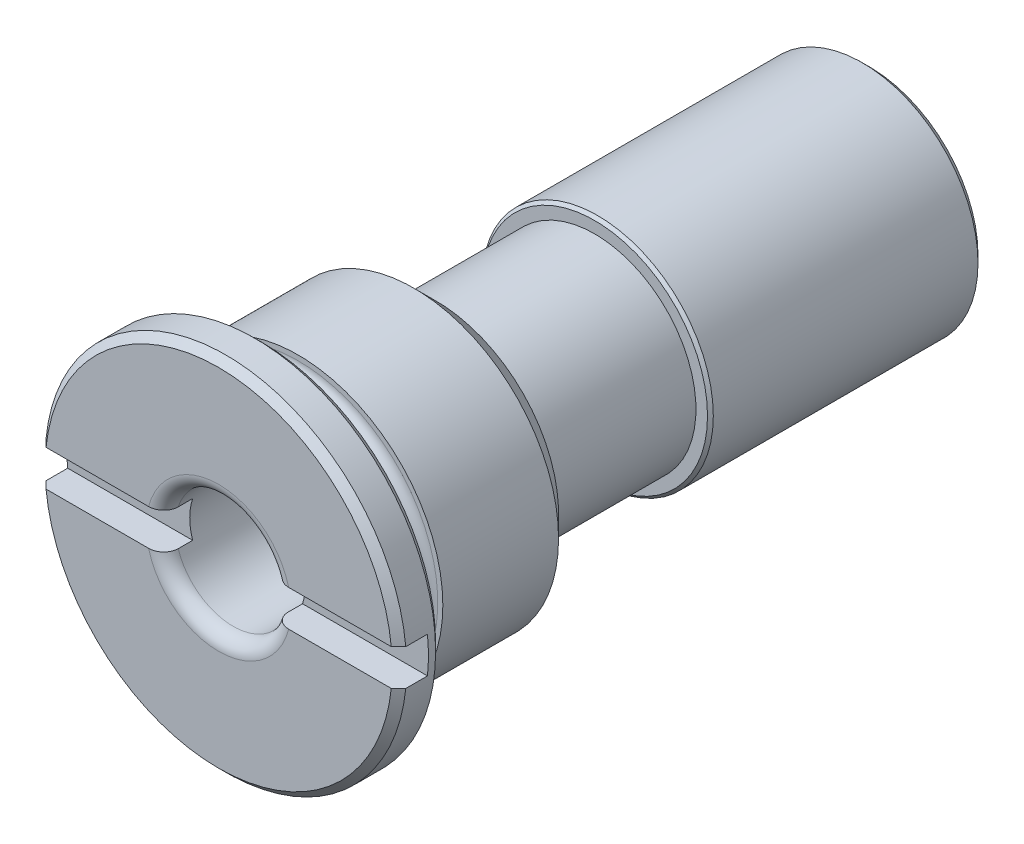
ISO-10303-21;
HEADER;
FILE_DESCRIPTION(('STEP AP214'),'2;1');
FILE_NAME('part.step','',(''),(''),'','','');
FILE_SCHEMA(('AUTOMOTIVE_DESIGN { 1 0 10303 214 1 1 1 1 }'));
ENDSEC;
DATA;
#1=APPLICATION_CONTEXT('core data for automotive mechanical design processes');
#2=APPLICATION_PROTOCOL_DEFINITION('international standard','automotive_design',2000,#1);
#3=PRODUCT_CONTEXT('',#1,'mechanical');
#4=PRODUCT('Part','Part','',(#3));
#5=PRODUCT_RELATED_PRODUCT_CATEGORY('part','',(#4));
#6=PRODUCT_DEFINITION_FORMATION('','',#4);
#7=PRODUCT_DEFINITION_CONTEXT('part definition',#1,'design');
#8=PRODUCT_DEFINITION('design','',#6,#7);
#9=PRODUCT_DEFINITION_SHAPE('','',#8);
#10=(LENGTH_UNIT() NAMED_UNIT(*) SI_UNIT(.MILLI.,.METRE.));
#11=(NAMED_UNIT(*) PLANE_ANGLE_UNIT() SI_UNIT($,.RADIAN.));
#12=(NAMED_UNIT(*) SI_UNIT($,.STERADIAN.) SOLID_ANGLE_UNIT());
#13=UNCERTAINTY_MEASURE_WITH_UNIT(LENGTH_MEASURE(1.E-05),#10,'distance_accuracy_value','');
#14=(GEOMETRIC_REPRESENTATION_CONTEXT(3) GLOBAL_UNCERTAINTY_ASSIGNED_CONTEXT((#13)) GLOBAL_UNIT_ASSIGNED_CONTEXT((#10,
#11,#12)) REPRESENTATION_CONTEXT('',''));
#15=CARTESIAN_POINT('',(0.,0.,0.));
#16=DIRECTION('',(0.,0.,1.));
#17=DIRECTION('',(1.,0.,0.));
#18=AXIS2_PLACEMENT_3D('',#15,#16,#17);
#19=CARTESIAN_POINT('',(0.,0.,-22.5021515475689));
#20=DIRECTION('',(0.,0.,1.));
#21=DIRECTION('',(-1.,0.,0.));
#22=AXIS2_PLACEMENT_3D('',#19,#20,#21);
#23=CONICAL_SURFACE('',#22,0.,1.02974425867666);
#24=CARTESIAN_POINT('',(0.,0.,-21.));
#25=DIRECTION('',(0.,0.,1.));
#26=DIRECTION('',(-1.,0.,0.));
#27=AXIS2_PLACEMENT_3D('',#24,#25,#26);
#28=CIRCLE('',#27,2.5);
#29=CARTESIAN_POINT('',(-2.5,0.,-21.));
#30=VERTEX_POINT('',#29);
#31=EDGE_CURVE('E254',#30,#30,#28,.T.);
#32=ORIENTED_EDGE('',*,*,#31,.T.);
#33=EDGE_LOOP('',(#32));
#34=FACE_BOUND('',#33,.T.);
#35=CARTESIAN_POINT('',(0.,0.,-22.5021515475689));
#36=VERTEX_POINT('',#35);
#37=VERTEX_LOOP('',#36);
#38=FACE_BOUND('',#37,.T.);
#39=ADVANCED_FACE('F14',(#34,#38),#23,.F.);
#40=CARTESIAN_POINT('',(0.,0.,-4.));
#41=DIRECTION('',(0.,0.,1.));
#42=DIRECTION('',(-1.,0.,0.));
#43=AXIS2_PLACEMENT_3D('',#40,#41,#42);
#44=CYLINDRICAL_SURFACE('',#43,2.5);
#45=CARTESIAN_POINT('',(-1.2099080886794,2.18772082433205,-14.));
#46=CARTESIAN_POINT('',(-1.20991191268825,2.18772274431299,-13.9059550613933));
#47=CARTESIAN_POINT('',(-1.2167075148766,2.18400275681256,-13.8118704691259));
#48=CARTESIAN_POINT('',(-1.24359970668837,2.16879960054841,-13.6261779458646));
#49=CARTESIAN_POINT('',(-1.26370935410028,2.15730881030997,-13.5345725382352));
#50=CARTESIAN_POINT('',(-1.31633811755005,2.12560550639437,-13.3563280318));
#51=CARTESIAN_POINT('',(-1.34888458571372,2.1053737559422,-13.2697003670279));
#52=CARTESIAN_POINT('',(-1.42473081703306,2.05480143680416,-13.104493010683));
#53=CARTESIAN_POINT('',(-1.4680185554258,2.02447215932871,-13.025904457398));
#54=CARTESIAN_POINT('',(-1.55321397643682,1.95953405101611,-12.8947188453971));
#55=CARTESIAN_POINT('',(-1.59361208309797,1.9270498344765,-12.8400862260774));
#56=CARTESIAN_POINT('',(-1.67799810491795,1.85403027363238,-12.7396193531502));
#57=CARTESIAN_POINT('',(-1.72198466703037,1.81349795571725,-12.6937818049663));
#58=CARTESIAN_POINT('',(-1.81180993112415,1.7237744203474,-12.6124845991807));
#59=CARTESIAN_POINT('',(-1.85766047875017,1.67451761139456,-12.5771093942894));
#60=CARTESIAN_POINT('',(-1.94830643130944,1.56810724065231,-12.5191754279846));
#61=CARTESIAN_POINT('',(-1.99310291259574,1.51096218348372,-12.4966029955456));
#62=CARTESIAN_POINT('',(-2.07294406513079,1.39891197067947,-12.4678883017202));
#63=CARTESIAN_POINT('',(-2.10847319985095,1.3448268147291,-12.4598783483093));
#64=CARTESIAN_POINT('',(-2.17537594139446,1.23366820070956,-12.4547898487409));
#65=CARTESIAN_POINT('',(-2.20675169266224,1.17659630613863,-12.4577056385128));
#66=CARTESIAN_POINT('',(-2.26198459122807,1.06626409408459,-12.4736020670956));
#67=CARTESIAN_POINT('',(-2.28624969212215,1.01308072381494,-12.4857269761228));
#68=CARTESIAN_POINT('',(-2.33019063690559,0.907460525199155,-12.518479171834));
#69=CARTESIAN_POINT('',(-2.34986625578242,0.855023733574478,-12.5391068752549));
#70=CARTESIAN_POINT('',(-2.38539686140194,0.750369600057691,-12.5890020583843));
#71=CARTESIAN_POINT('',(-2.40107748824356,0.69823692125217,-12.6185690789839));
#72=CARTESIAN_POINT('',(-2.42808080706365,0.597614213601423,-12.6849656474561));
#73=CARTESIAN_POINT('',(-2.43940176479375,0.549125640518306,-12.7217980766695));
#74=CARTESIAN_POINT('',(-2.45956711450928,0.450944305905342,-12.8067162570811));
#75=CARTESIAN_POINT('',(-2.46791810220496,0.401872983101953,-12.8556357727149));
#76=CARTESIAN_POINT('',(-2.48106126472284,0.310589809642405,-12.9599126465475));
#77=CARTESIAN_POINT('',(-2.48585143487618,0.268381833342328,-13.0152736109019));
#78=CARTESIAN_POINT('',(-2.49352519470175,0.185323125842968,-13.1404195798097));
#79=CARTESIAN_POINT('',(-2.4959805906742,0.145772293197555,-13.2110946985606));
#80=CARTESIAN_POINT('',(-2.49903462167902,0.0774384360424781,-13.3575077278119));
#81=CARTESIAN_POINT('',(-2.49963223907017,0.0486613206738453,-13.4332483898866));
#82=CARTESIAN_POINT('',(-2.50013845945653,-0.000663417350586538,-13.5978646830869));
#83=CARTESIAN_POINT('',(-2.49995061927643,-0.0197146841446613,-13.6871918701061));
#84=CARTESIAN_POINT('',(-2.4996513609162,-0.043372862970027,-13.8677419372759));
#85=CARTESIAN_POINT('',(-2.49953996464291,-0.0479756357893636,-13.9589653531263));
#86=CARTESIAN_POINT('',(-2.49964097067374,-0.0425260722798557,-14.1458011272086));
#87=CARTESIAN_POINT('',(-2.49987072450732,-0.0316896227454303,-14.2413917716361));
#88=CARTESIAN_POINT('',(-2.50006285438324,0.00591749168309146,-14.4294424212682));
#89=CARTESIAN_POINT('',(-2.50002510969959,0.0326953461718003,-14.5219009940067));
#90=CARTESIAN_POINT('',(-2.49816987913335,0.101643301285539,-14.7006356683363));
#91=CARTESIAN_POINT('',(-2.49635681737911,0.143774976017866,-14.7869265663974));
#92=CARTESIAN_POINT('',(-2.488695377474,0.24255991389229,-14.9505413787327));
#93=CARTESIAN_POINT('',(-2.48285215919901,0.299194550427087,-15.0278766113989));
#94=CARTESIAN_POINT('',(-2.46653180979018,0.410611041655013,-15.153655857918));
#95=CARTESIAN_POINT('',(-2.45745242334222,0.462747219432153,-15.204632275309));
#96=CARTESIAN_POINT('',(-2.43400618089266,0.573415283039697,-15.2977083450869));
#97=CARTESIAN_POINT('',(-2.41964193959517,0.631943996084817,-15.3398123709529));
#98=CARTESIAN_POINT('',(-2.38439756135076,0.754131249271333,-15.4136497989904));
#99=CARTESIAN_POINT('',(-2.36346909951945,0.817825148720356,-15.4453025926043));
#100=CARTESIAN_POINT('',(-2.31453520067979,0.947472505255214,-15.4960499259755));
#101=CARTESIAN_POINT('',(-2.28653644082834,1.0134237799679,-15.5151562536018));
#102=CARTESIAN_POINT('',(-2.22796909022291,1.13583923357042,-15.5379799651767));
#103=CARTESIAN_POINT('',(-2.19824627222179,1.19239154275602,-15.5434150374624));
#104=CARTESIAN_POINT('',(-2.13451460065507,1.30304092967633,-15.5436996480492));
#105=CARTESIAN_POINT('',(-2.1005075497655,1.3571390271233,-15.538553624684));
#106=CARTESIAN_POINT('',(-2.03195062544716,1.45760910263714,-15.5186733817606));
#107=CARTESIAN_POINT('',(-1.99760045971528,1.5042566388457,-15.5046259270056));
#108=CARTESIAN_POINT('',(-1.92754041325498,1.59304365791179,-15.4682117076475));
#109=CARTESIAN_POINT('',(-1.89183040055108,1.63518270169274,-15.4458441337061));
#110=CARTESIAN_POINT('',(-1.81854121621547,1.71640646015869,-15.3923144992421));
#111=CARTESIAN_POINT('',(-1.78095797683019,1.75523261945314,-15.3607681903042));
#112=CARTESIAN_POINT('',(-1.70707429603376,1.8271731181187,-15.2905087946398));
#113=CARTESIAN_POINT('',(-1.67077437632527,1.86028515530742,-15.2517928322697));
#114=CARTESIAN_POINT('',(-1.59598281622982,1.92499369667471,-15.1627220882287));
#115=CARTESIAN_POINT('',(-1.55784084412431,1.955804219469,-15.1115043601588));
#116=CARTESIAN_POINT('',(-1.48612579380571,2.01084009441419,-15.0027272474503));
#117=CARTESIAN_POINT('',(-1.45255587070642,2.03506091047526,-14.9451635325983));
#118=CARTESIAN_POINT('',(-1.38616839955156,2.08096652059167,-14.8154126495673));
#119=CARTESIAN_POINT('',(-1.35433145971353,2.10162474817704,-14.7423596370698));
#120=CARTESIAN_POINT('',(-1.29957831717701,2.13591733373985,-14.5914551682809));
#121=CARTESIAN_POINT('',(-1.27666196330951,2.14955181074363,-14.5136037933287));
#122=CARTESIAN_POINT('',(-1.24253877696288,2.16943341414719,-14.3634731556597));
#123=CARTESIAN_POINT('',(-1.23033328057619,2.17632021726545,-14.291502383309));
#124=CARTESIAN_POINT('',(-1.21401604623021,2.18546340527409,-14.1463624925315));
#125=CARTESIAN_POINT('',(-1.20990511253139,2.18771933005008,-14.0731932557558));
#126=CARTESIAN_POINT('',(-1.2099080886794,2.18772082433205,-14.));
#127=B_SPLINE_CURVE_WITH_KNOTS('',3,(#45,#46,#47,#48,#49,#50,#51,#52,#53,#54,#55,#56,#57,#58,
#59,#60,#61,#62,#63,#64,#65,#66,#67,#68,#69,#70,#71,#72,#73,#74,#75,#76,#77,#78,#79,#80,#81,#82,
#83,#84,#85,#86,#87,#88,#89,#90,#91,#92,#93,#94,#95,#96,#97,#98,#99,#100,#101,#102,#103,#104,
#105,#106,#107,#108,#109,#110,#111,#112,#113,#114,#115,#116,#117,#118,#119,#120,#121,#122,#123,
#124,#125,#126),.UNSPECIFIED.,.T.,.F.,(4,2,2,2,2,2,2,2,2,2,2,2,2,2,2,2,2,2,2,2,2,2,2,2,2,2,2,2,
2,2,2,2,2,2,2,2,2,2,2,2,4),(0.,0.281885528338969,0.564047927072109,0.846834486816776,
1.12930588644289,1.35433308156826,1.57927581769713,1.80598763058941,2.03245689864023,
2.2269984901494,2.42143924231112,2.59973661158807,2.7780427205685,2.96315008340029,
3.14833100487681,3.3569011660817,3.56558865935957,3.80769723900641,4.04993841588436,
4.32274224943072,4.59562422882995,4.88286916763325,5.17024375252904,5.45690401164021,
5.74319793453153,5.96275344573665,6.18220047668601,6.40330254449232,6.62419658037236,
6.81551999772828,7.00676317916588,7.18479797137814,7.3628500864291,7.5498168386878,
7.73685874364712,7.94875359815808,8.16079394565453,8.40677620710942,8.65275429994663,
8.8721182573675,9.09150400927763),.UNSPECIFIED.);
#128=CARTESIAN_POINT('',(-1.2099080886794,2.18772082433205,-14.));
#129=VERTEX_POINT('',#128);
#130=EDGE_CURVE('E9',#129,#129,#127,.T.);
#131=ORIENTED_EDGE('',*,*,#130,.F.);
#132=EDGE_LOOP('',(#131));
#133=FACE_BOUND('',#132,.T.);
#134=CARTESIAN_POINT('',(1.20990808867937,2.18772082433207,-14.));
#135=CARTESIAN_POINT('',(1.20991191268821,2.18772274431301,-14.0940449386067));
#136=CARTESIAN_POINT('',(1.21670751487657,2.18400275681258,-14.1881295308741));
#137=CARTESIAN_POINT('',(1.24359970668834,2.16879960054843,-14.3738220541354));
#138=CARTESIAN_POINT('',(1.26370935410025,2.15730881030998,-14.4654274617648));
#139=CARTESIAN_POINT('',(1.31633811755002,2.12560550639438,-14.6436719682));
#140=CARTESIAN_POINT('',(1.3488845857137,2.10537375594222,-14.7302996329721));
#141=CARTESIAN_POINT('',(1.42473081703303,2.05480143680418,-14.895506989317));
#142=CARTESIAN_POINT('',(1.46801855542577,2.02447215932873,-14.974095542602));
#143=CARTESIAN_POINT('',(1.55321397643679,1.95953405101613,-15.1052811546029));
#144=CARTESIAN_POINT('',(1.59361208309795,1.92704983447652,-15.1599137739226));
#145=CARTESIAN_POINT('',(1.67799810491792,1.8540302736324,-15.2603806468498));
#146=CARTESIAN_POINT('',(1.72198466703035,1.81349795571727,-15.3062181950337));
#147=CARTESIAN_POINT('',(1.81180993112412,1.72377442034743,-15.3875154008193));
#148=CARTESIAN_POINT('',(1.85766047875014,1.67451761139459,-15.4228906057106));
#149=CARTESIAN_POINT('',(1.94830643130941,1.56810724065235,-15.4808245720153));
#150=CARTESIAN_POINT('',(1.99310291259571,1.51096218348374,-15.5033970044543));
#151=CARTESIAN_POINT('',(2.07294406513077,1.3989119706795,-15.5321116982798));
#152=CARTESIAN_POINT('',(2.10847319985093,1.34482681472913,-15.5401216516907));
#153=CARTESIAN_POINT('',(2.17537594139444,1.2336682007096,-15.5452101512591));
#154=CARTESIAN_POINT('',(2.20675169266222,1.17659630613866,-15.5422943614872));
#155=CARTESIAN_POINT('',(2.26198459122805,1.06626409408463,-15.5263979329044));
#156=CARTESIAN_POINT('',(2.28624969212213,1.01308072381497,-15.5142730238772));
#157=CARTESIAN_POINT('',(2.33019063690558,0.907460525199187,-15.481520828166));
#158=CARTESIAN_POINT('',(2.34986625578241,0.855023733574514,-15.4608931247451));
#159=CARTESIAN_POINT('',(2.38539686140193,0.75036960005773,-15.4109979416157));
#160=CARTESIAN_POINT('',(2.40107748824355,0.698236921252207,-15.3814309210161));
#161=CARTESIAN_POINT('',(2.42808080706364,0.597614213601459,-15.3150343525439));
#162=CARTESIAN_POINT('',(2.43940176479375,0.549125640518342,-15.2782019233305));
#163=CARTESIAN_POINT('',(2.45956711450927,0.450944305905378,-15.1932837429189));
#164=CARTESIAN_POINT('',(2.46791810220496,0.401872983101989,-15.1443642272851));
#165=CARTESIAN_POINT('',(2.48106126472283,0.310589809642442,-15.0400873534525));
#166=CARTESIAN_POINT('',(2.48585143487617,0.268381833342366,-14.9847263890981));
#167=CARTESIAN_POINT('',(2.49352519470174,0.185323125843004,-14.8595804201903));
#168=CARTESIAN_POINT('',(2.4959805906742,0.145772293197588,-14.7889053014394));
#169=CARTESIAN_POINT('',(2.49903462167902,0.0774384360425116,-14.6424922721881));
#170=CARTESIAN_POINT('',(2.49963223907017,0.0486613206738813,-14.5667516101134));
#171=CARTESIAN_POINT('',(2.50013845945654,-0.000663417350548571,-14.4021353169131));
#172=CARTESIAN_POINT('',(2.49995061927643,-0.019714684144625,-14.3128081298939));
#173=CARTESIAN_POINT('',(2.4996513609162,-0.0433728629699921,-14.1322580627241));
#174=CARTESIAN_POINT('',(2.49953996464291,-0.0479756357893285,-14.0410346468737));
#175=CARTESIAN_POINT('',(2.49964097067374,-0.0425260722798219,-13.8541988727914));
#176=CARTESIAN_POINT('',(2.49987072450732,-0.031689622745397,-13.7586082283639));
#177=CARTESIAN_POINT('',(2.50006285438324,0.00591749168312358,-13.5705575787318));
#178=CARTESIAN_POINT('',(2.50002510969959,0.0326953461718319,-13.4780990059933));
#179=CARTESIAN_POINT('',(2.49816987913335,0.101643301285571,-13.2993643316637));
#180=CARTESIAN_POINT('',(2.4963568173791,0.143774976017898,-13.2130734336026));
#181=CARTESIAN_POINT('',(2.488695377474,0.242559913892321,-13.0494586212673));
#182=CARTESIAN_POINT('',(2.48285215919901,0.299194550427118,-12.9721233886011));
#183=CARTESIAN_POINT('',(2.46653180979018,0.410611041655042,-12.8463441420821));
#184=CARTESIAN_POINT('',(2.45745242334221,0.462747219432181,-12.795367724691));
#185=CARTESIAN_POINT('',(2.43400618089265,0.573415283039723,-12.7022916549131));
#186=CARTESIAN_POINT('',(2.41964193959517,0.631943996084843,-12.6601876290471));
#187=CARTESIAN_POINT('',(2.38439756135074,0.754131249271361,-12.5863502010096));
#188=CARTESIAN_POINT('',(2.36346909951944,0.817825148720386,-12.5546974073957));
#189=CARTESIAN_POINT('',(2.31453520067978,0.947472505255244,-12.5039500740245));
#190=CARTESIAN_POINT('',(2.28653644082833,1.01342377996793,-12.4848437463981));
#191=CARTESIAN_POINT('',(2.2279690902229,1.13583923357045,-12.4620200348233));
#192=CARTESIAN_POINT('',(2.19824627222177,1.19239154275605,-12.4565849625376));
#193=CARTESIAN_POINT('',(2.13451460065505,1.30304092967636,-12.4563003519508));
#194=CARTESIAN_POINT('',(2.10050754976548,1.35713902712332,-12.461446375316));
#195=CARTESIAN_POINT('',(2.03195062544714,1.45760910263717,-12.4813266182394));
#196=CARTESIAN_POINT('',(1.99760045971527,1.50425663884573,-12.4953740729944));
#197=CARTESIAN_POINT('',(1.92754041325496,1.59304365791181,-12.5317882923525));
#198=CARTESIAN_POINT('',(1.89183040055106,1.63518270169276,-12.5541558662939));
#199=CARTESIAN_POINT('',(1.81854121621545,1.71640646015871,-12.6076855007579));
#200=CARTESIAN_POINT('',(1.78095797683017,1.75523261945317,-12.6392318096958));
#201=CARTESIAN_POINT('',(1.70707429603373,1.82717311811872,-12.7094912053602));
#202=CARTESIAN_POINT('',(1.67077437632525,1.86028515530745,-12.7482071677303));
#203=CARTESIAN_POINT('',(1.5959828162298,1.92499369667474,-12.8372779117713));
#204=CARTESIAN_POINT('',(1.55784084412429,1.95580421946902,-12.8884956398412));
#205=CARTESIAN_POINT('',(1.48612579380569,2.01084009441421,-12.9972727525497));
#206=CARTESIAN_POINT('',(1.4525558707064,2.03506091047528,-13.0548364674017));
#207=CARTESIAN_POINT('',(1.38616839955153,2.08096652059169,-13.1845873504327));
#208=CARTESIAN_POINT('',(1.3543314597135,2.10162474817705,-13.2576403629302));
#209=CARTESIAN_POINT('',(1.29957831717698,2.13591733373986,-13.4085448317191));
#210=CARTESIAN_POINT('',(1.27666196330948,2.14955181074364,-13.4863962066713));
#211=CARTESIAN_POINT('',(1.24253877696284,2.1694334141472,-13.6365268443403));
#212=CARTESIAN_POINT('',(1.23033328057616,2.17632021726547,-13.708497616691));
#213=CARTESIAN_POINT('',(1.21401604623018,2.18546340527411,-13.8536375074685));
#214=CARTESIAN_POINT('',(1.20990511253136,2.1877193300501,-13.9268067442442));
#215=CARTESIAN_POINT('',(1.20990808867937,2.18772082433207,-14.));
#216=B_SPLINE_CURVE_WITH_KNOTS('',3,(#134,#135,#136,#137,#138,#139,#140,#141,#142,#143,#144,
#145,#146,#147,#148,#149,#150,#151,#152,#153,#154,#155,#156,#157,#158,#159,#160,#161,#162,#163,
#164,#165,#166,#167,#168,#169,#170,#171,#172,#173,#174,#175,#176,#177,#178,#179,#180,#181,#182,
#183,#184,#185,#186,#187,#188,#189,#190,#191,#192,#193,#194,#195,#196,#197,#198,#199,#200,#201,
#202,#203,#204,#205,#206,#207,#208,#209,#210,#211,#212,#213,#214,#215),.UNSPECIFIED.,.T.,.F.,(4,
2,2,2,2,2,2,2,2,2,2,2,2,2,2,2,2,2,2,2,2,2,2,2,2,2,2,2,2,2,2,2,2,2,2,2,2,2,2,2,4),(0.,
0.281885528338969,0.56404792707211,0.84683448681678,1.12930588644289,1.35433308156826,
1.57927581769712,1.8059876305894,2.03245689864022,2.22699849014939,2.42143924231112,
2.59973661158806,2.77804272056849,2.96315008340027,3.1483310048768,3.35690116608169,
3.56558865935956,3.8076972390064,4.04993841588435,4.3227422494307,4.59562422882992,
4.88286916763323,5.17024375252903,5.45690401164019,5.74319793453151,5.96275344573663,
6.182200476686,6.40330254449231,6.62419658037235,6.81551999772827,7.00676317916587,
7.18479797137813,7.36285008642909,7.54981683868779,7.73685874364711,7.94875359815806,
8.1607939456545,8.4067762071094,8.65275429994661,8.87211825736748,9.09150400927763),.UNSPECIFIED.);
#217=CARTESIAN_POINT('',(1.20990808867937,2.18772082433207,-14.));
#218=VERTEX_POINT('',#217);
#219=EDGE_CURVE('E24',#218,#218,#216,.T.);
#220=ORIENTED_EDGE('',*,*,#219,.F.);
#221=EDGE_LOOP('',(#220));
#222=FACE_BOUND('',#221,.T.);
#223=CARTESIAN_POINT('',(-1.28966776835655,-2.14167153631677,-14.));
#224=CARTESIAN_POINT('',(-1.28966751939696,-2.14167580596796,-13.905955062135));
#225=CARTESIAN_POINT('',(-1.28304811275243,-2.14570099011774,-13.8118704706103));
#226=CARTESIAN_POINT('',(-1.25643569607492,-2.16138874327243,-13.6261779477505));
#227=CARTESIAN_POINT('',(-1.2364295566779,-2.17305880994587,-13.5345725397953));
#228=CARTESIAN_POINT('',(-1.18265930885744,-2.20278500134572,-13.3563280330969));
#229=CARTESIAN_POINT('',(-1.14886486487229,-2.22085519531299,-13.2697003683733));
#230=CARTESIAN_POINT('',(-1.06714483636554,-2.26125379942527,-13.1044930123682));
#231=CARTESIAN_POINT('',(-1.019235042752,-2.2835774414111,-13.0259044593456));
#232=CARTESIAN_POINT('',(-0.920399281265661,-2.32488978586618,-12.8947188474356));
#233=CARTESIAN_POINT('',(-0.872068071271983,-2.3436334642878,-12.8400862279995));
#234=CARTESIAN_POINT('',(-0.766638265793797,-2.38020412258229,-12.7396193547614));
#235=CARTESIAN_POINT('',(-0.709542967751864,-2.39803144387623,-12.6937818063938));
#236=CARTESIAN_POINT('',(-0.586927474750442,-2.43096063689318,-12.6124846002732));
#237=CARTESIAN_POINT('',(-0.521344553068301,-2.44603997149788,-12.5771093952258));
#238=CARTESIAN_POINT('',(-0.383867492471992,-2.47133648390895,-12.519175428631));
#239=CARTESIAN_POINT('',(-0.311980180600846,-2.48155884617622,-12.4966029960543));
#240=CARTESIAN_POINT('',(-0.175021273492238,-2.49467820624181,-12.4678883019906));
#241=CARTESIAN_POINT('',(-0.110417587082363,-2.49840476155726,-12.4598783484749));
#242=CARTESIAN_POINT('',(0.0192999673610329,-2.500764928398,-12.4547898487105));
#243=CARTESIAN_POINT('',(0.0844135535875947,-2.49940117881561,-12.4577056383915));
#244=CARTESIAN_POINT('',(0.207580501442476,-2.49206816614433,-12.4736020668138));
#245=CARTESIAN_POINT('',(0.265771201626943,-2.48649067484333,-12.4857269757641));
#246=CARTESIAN_POINT('',(0.379211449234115,-2.47173455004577,-12.5184791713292));
#247=CARTESIAN_POINT('',(0.434460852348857,-2.46255574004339,-12.5391068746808));
#248=CARTESIAN_POINT('',(0.542859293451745,-2.44099908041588,-12.5890020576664));
#249=CARTESIAN_POINT('',(0.595847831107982,-2.42851256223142,-12.618569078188));
#250=CARTESIAN_POINT('',(0.696491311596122,-2.40158676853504,-12.684965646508));
#251=CARTESIAN_POINT('',(0.744144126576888,-2.38714671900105,-12.7217980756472));
#252=CARTESIAN_POINT('',(0.839254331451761,-2.35551975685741,-12.8067162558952));
#253=CARTESIAN_POINT('',(0.885926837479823,-2.33821626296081,-12.8556357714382));
#254=CARTESIAN_POINT('',(0.971551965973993,-2.30395698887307,-12.9599126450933));
#255=CARTESIAN_POINT('',(1.01050023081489,-2.28700140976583,-13.0152736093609));
#256=CARTESIAN_POINT('',(1.08626806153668,-2.2521177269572,-13.1404195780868));
#257=CARTESIAN_POINT('',(1.12174778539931,-2.23446874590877,-13.2110946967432));
#258=CARTESIAN_POINT('',(1.18245365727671,-2.20294668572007,-13.3575077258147));
#259=CARTESIAN_POINT('',(1.20767417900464,-2.18907567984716,-13.433248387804));
#260=CARTESIAN_POINT('',(1.25064376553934,-2.16485171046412,-13.5978646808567));
#261=CARTESIAN_POINT('',(1.26704872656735,-2.15516340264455,-13.6871918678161));
#262=CARTESIAN_POINT('',(1.28738768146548,-2.14307514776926,-13.8677419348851));
#263=CARTESIAN_POINT('',(1.29131810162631,-2.14067728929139,-13.9589653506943));
#264=CARTESIAN_POINT('',(1.28664914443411,-2.14348954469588,-14.1458011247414));
#265=CARTESIAN_POINT('',(1.27737938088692,-2.14910674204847,-14.2413917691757));
#266=CARTESIAN_POINT('',(1.24490672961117,-2.16807668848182,-14.4294424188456));
#267=CARTESIAN_POINT('',(1.22169755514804,-2.18143292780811,-14.5219009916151));
#268=CARTESIAN_POINT('',(1.16105925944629,-2.21430022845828,-14.7006356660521));
#269=CARTESIAN_POINT('',(1.123665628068,-2.23379590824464,-14.7869265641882));
#270=CARTESIAN_POINT('',(1.03428464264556,-2.27655337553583,-14.9505413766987));
#271=CARTESIAN_POINT('',(0.982315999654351,-2.29981031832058,-15.027876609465));
#272=CARTESIAN_POINT('',(0.877666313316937,-2.34138472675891,-15.1536558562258));
#273=CARTESIAN_POINT('',(0.827975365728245,-2.35958983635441,-15.2046322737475));
#274=CARTESIAN_POINT('',(0.720410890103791,-2.39461882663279,-15.297708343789));
#275=CARTESIAN_POINT('',(0.662541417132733,-2.4114433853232,-15.3398123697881));
#276=CARTESIAN_POINT('',(0.539101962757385,-2.44201448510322,-15.4136497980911));
#277=CARTESIAN_POINT('',(0.473477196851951,-2.45573685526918,-15.4453025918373));
#278=CARTESIAN_POINT('',(0.336732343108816,-2.47818253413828,-15.4960499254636));
#279=CARTESIAN_POINT('',(0.265617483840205,-2.48691053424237,-15.5151562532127));
#280=CARTESIAN_POINT('',(0.130318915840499,-2.49739744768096,-15.5379799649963));
#281=CARTESIAN_POINT('',(0.0664817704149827,-2.49993288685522,-15.5434150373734));
#282=CARTESIAN_POINT('',(-0.0612092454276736,-2.50006433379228,-15.5436996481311));
#283=CARTESIAN_POINT('',(-0.125063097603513,-2.49766241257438,-15.5385536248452));
#284=CARTESIAN_POINT('',(-0.246351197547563,-2.48852541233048,-15.5186733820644));
#285=CARTESIAN_POINT('',(-0.303924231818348,-2.48210106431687,-15.5046259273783));
#286=CARTESIAN_POINT('',(-0.415846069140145,-2.46582079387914,-15.4682117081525));
#287=CARTESIAN_POINT('',(-0.470194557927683,-2.4559645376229,-15.4458441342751));
#288=CARTESIAN_POINT('',(-0.577180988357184,-2.43310612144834,-15.3923144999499));
#289=CARTESIAN_POINT('',(-0.629597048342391,-2.41997116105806,-15.3607681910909));
#290=CARTESIAN_POINT('',(-0.728841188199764,-2.39195626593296,-15.290508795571));
#291=CARTESIAN_POINT('',(-0.775667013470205,-2.3770756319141,-15.2517928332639));
#292=CARTESIAN_POINT('',(-0.869102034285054,-2.34465851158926,-15.1627220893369));
#293=CARTESIAN_POINT('',(-0.914855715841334,-2.32703185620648,-15.1115043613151));
#294=CARTESIAN_POINT('',(-0.99837570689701,-2.29244273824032,-15.0027272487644));
#295=CARTESIAN_POINT('',(-1.03613651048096,-2.27548074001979,-14.9451635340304));
#296=CARTESIAN_POINT('',(-1.1090856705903,-2.24094030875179,-14.8154126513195));
#297=CARTESIAN_POINT('',(-1.14289469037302,-2.22369782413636,-14.74235963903));
#298=CARTESIAN_POINT('',(-1.1999695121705,-2.19342650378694,-14.5914551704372));
#299=CARTESIAN_POINT('',(-1.22323549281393,-2.18039759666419,-14.513603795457));
#300=CARTESIAN_POINT('',(-1.25751505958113,-2.16078685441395,-14.3634731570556));
#301=CARTESIAN_POINT('',(-1.26958195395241,-2.15365998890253,-14.2915023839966));
#302=CARTESIAN_POINT('',(-1.28565880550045,-2.14410043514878,-14.1463624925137));
#303=CARTESIAN_POINT('',(-1.28966796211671,-2.14166821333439,-14.0731932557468));
#304=CARTESIAN_POINT('',(-1.28966776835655,-2.14167153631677,-14.));
#305=B_SPLINE_CURVE_WITH_KNOTS('',3,(#223,#224,#225,#226,#227,#228,#229,#230,#231,#232,#233,
#234,#235,#236,#237,#238,#239,#240,#241,#242,#243,#244,#245,#246,#247,#248,#249,#250,#251,#252,
#253,#254,#255,#256,#257,#258,#259,#260,#261,#262,#263,#264,#265,#266,#267,#268,#269,#270,#271,
#272,#273,#274,#275,#276,#277,#278,#279,#280,#281,#282,#283,#284,#285,#286,#287,#288,#289,#290,
#291,#292,#293,#294,#295,#296,#297,#298,#299,#300,#301,#302,#303,#304),.UNSPECIFIED.,.T.,.F.,(4,
2,2,2,2,2,2,2,2,2,2,2,2,2,2,2,2,2,2,2,2,2,2,2,2,2,2,2,2,2,2,2,2,2,2,2,2,2,2,2,4),(0.,
0.281885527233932,0.564047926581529,0.846834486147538,1.12930588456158,1.35433307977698,
1.57927581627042,1.80598762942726,2.03245689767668,2.22699848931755,2.42143924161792,
2.59973661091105,2.77804271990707,2.96315008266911,3.14833100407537,3.35690116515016,
3.56558865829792,3.80769723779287,4.04993841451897,4.32274224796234,4.59562422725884,
4.88286916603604,5.17024375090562,5.45690401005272,5.74319793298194,5.96275344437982,
6.18220047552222,6.40330254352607,6.62419657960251,6.81551999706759,7.00676317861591,
7.18479797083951,7.36285008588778,7.54981683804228,7.73685874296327,7.94875359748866,
8.16079394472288,8.40677620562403,8.6527542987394,8.87211825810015,9.0915040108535),.UNSPECIFIED.);
#306=CARTESIAN_POINT('',(-1.28966776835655,-2.14167153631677,-14.));
#307=VERTEX_POINT('',#306);
#308=EDGE_CURVE('E316',#307,#307,#305,.T.);
#309=ORIENTED_EDGE('',*,*,#308,.F.);
#310=EDGE_LOOP('',(#309));
#311=FACE_BOUND('',#310,.T.);
#312=CARTESIAN_POINT('',(0.,0.,-10.5));
#313=DIRECTION('',(0.,0.,1.));
#314=DIRECTION('',(-1.,0.,0.));
#315=AXIS2_PLACEMENT_3D('',#312,#313,#314);
#316=CIRCLE('',#315,2.5);
#317=CARTESIAN_POINT('',(-2.5,0.,-10.5));
#318=VERTEX_POINT('',#317);
#319=EDGE_CURVE('E248',#318,#318,#316,.T.);
#320=ORIENTED_EDGE('',*,*,#319,.T.);
#321=EDGE_LOOP('',(#320));
#322=FACE_BOUND('',#321,.T.);
#323=ORIENTED_EDGE('',*,*,#31,.F.);
#324=EDGE_LOOP('',(#323));
#325=FACE_BOUND('',#324,.T.);
#326=ADVANCED_FACE('F307',(#133,#222,#311,#322,#325),#44,.F.);
#327=CARTESIAN_POINT('',(0.,-4.,-10.5));
#328=DIRECTION('',(0.,0.,-1.));
#329=DIRECTION('',(1.,0.,0.));
#330=AXIS2_PLACEMENT_3D('',#327,#328,#329);
#331=PLANE('',#330);
#332=ORIENTED_EDGE('',*,*,#319,.F.);
#333=EDGE_LOOP('',(#332));
#334=FACE_BOUND('',#333,.T.);
#335=CARTESIAN_POINT('',(0.,0.,-10.5));
#336=DIRECTION('',(0.,0.,1.));
#337=DIRECTION('',(-1.,0.,0.));
#338=AXIS2_PLACEMENT_3D('',#335,#336,#337);
#339=CIRCLE('',#338,4.);
#340=CARTESIAN_POINT('',(-4.,0.,-10.5));
#341=VERTEX_POINT('',#340);
#342=EDGE_CURVE('E245',#341,#341,#339,.T.);
#343=ORIENTED_EDGE('',*,*,#342,.T.);
#344=EDGE_LOOP('',(#343));
#345=FACE_BOUND('',#344,.T.);
#346=ADVANCED_FACE('F311',(#334,#345),#331,.F.);
#347=CARTESIAN_POINT('',(0.,-5.,3.));
#348=DIRECTION('',(0.,0.,-1.));
#349=DIRECTION('',(1.,0.,0.));
#350=AXIS2_PLACEMENT_3D('',#347,#348,#349);
#351=PLANE('',#350);
#352=CARTESIAN_POINT('',(0.,0.,3.));
#353=DIRECTION('',(0.,0.,-1.));
#354=DIRECTION('',(1.,0.,0.));
#355=AXIS2_PLACEMENT_3D('',#352,#353,#354);
#356=CIRCLE('',#355,12.);
#357=CARTESIAN_POINT('',(-11.93471826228,-1.25,3.));
#358=VERTEX_POINT('',#357);
#359=CARTESIAN_POINT('',(11.93471826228,-1.25,3.));
#360=VERTEX_POINT('',#359);
#361=EDGE_CURVE('E137',#358,#360,#356,.F.);
#362=ORIENTED_EDGE('',*,*,#361,.T.);
#363=DIRECTION('',(1.,0.,0.));
#364=VECTOR('',#363,1.);
#365=CARTESIAN_POINT('',(15.6357209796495,-1.25,3.));
#366=LINE('',#365,#364);
#367=CARTESIAN_POINT('',(4.84122918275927,-1.25,3.));
#368=VERTEX_POINT('',#367);
#369=EDGE_CURVE('E32',#368,#360,#366,.T.);
#370=ORIENTED_EDGE('',*,*,#369,.F.);
#371=CARTESIAN_POINT('',(0.,0.,3.));
#372=DIRECTION('',(0.,0.,1.));
#373=DIRECTION('',(-1.,0.,0.));
#374=AXIS2_PLACEMENT_3D('',#371,#372,#373);
#375=CIRCLE('',#374,5.);
#376=CARTESIAN_POINT('',(-4.84122918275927,-1.25,3.));
#377=VERTEX_POINT('',#376);
#378=EDGE_CURVE('E238',#377,#368,#375,.T.);
#379=ORIENTED_EDGE('',*,*,#378,.F.);
#380=EDGE_CURVE('E378',#358,#377,#366,.T.);
#381=ORIENTED_EDGE('',*,*,#380,.F.);
#382=EDGE_LOOP('',(#362,#370,#379,#381));
#383=FACE_BOUND('',#382,.T.);
#384=ADVANCED_FACE('F184',(#383),#351,.F.);
#385=CARTESIAN_POINT('',(0.,0.,2.));
#386=DIRECTION('',(0.,0.,1.));
#387=DIRECTION('',(-1.,0.,0.));
#388=AXIS2_PLACEMENT_3D('',#385,#386,#387);
#389=TOROIDAL_SURFACE('',#388,5.,1.);
#390=ORIENTED_EDGE('',*,*,#378,.T.);
#391=CARTESIAN_POINT('',(4.55376941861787,-1.25,2.96064331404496));
#392=CARTESIAN_POINT('',(4.49661420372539,-1.25,2.94470333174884));
#393=CARTESIAN_POINT('',(4.44074604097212,-1.25,2.92399416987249));
#394=CARTESIAN_POINT('',(4.33318671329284,-1.25,2.87354219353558));
#395=CARTESIAN_POINT('',(4.28150057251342,-1.25,2.84378871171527));
#396=CARTESIAN_POINT('',(4.18384568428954,-1.25,2.77595213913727));
#397=CARTESIAN_POINT('',(4.13788097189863,-1.25,2.73786322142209));
#398=CARTESIAN_POINT('',(4.05321064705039,-1.25,2.65433655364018));
#399=CARTESIAN_POINT('',(4.01450245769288,-1.25,2.60890142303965));
#400=CARTESIAN_POINT('',(3.94657016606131,-1.25,2.5131166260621));
#401=CARTESIAN_POINT('',(3.9171331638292,-1.25,2.46291821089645));
#402=CARTESIAN_POINT('',(3.86757955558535,-1.25,2.35811127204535));
#403=CARTESIAN_POINT('',(3.84746035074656,-1.25,2.30350398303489));
#404=CARTESIAN_POINT('',(3.81807426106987,-1.25,2.19415668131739));
#405=CARTESIAN_POINT('',(3.80834780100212,-1.25,2.13954001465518));
#406=CARTESIAN_POINT('',(3.79852333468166,-1.25,2.0294516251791));
#407=CARTESIAN_POINT('',(3.79842322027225,-1.25,1.97398009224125));
#408=CARTESIAN_POINT('',(3.80770635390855,-1.25,1.86554394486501));
#409=CARTESIAN_POINT('',(3.81680171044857,-1.25,1.81255435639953));
#410=CARTESIAN_POINT('',(3.84369135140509,-1.25,1.70883581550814));
#411=CARTESIAN_POINT('',(3.86148576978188,-1.25,1.65810689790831));
#412=CARTESIAN_POINT('',(3.90531133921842,-1.25,1.55985136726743));
#413=CARTESIAN_POINT('',(3.93140882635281,-1.25,1.51235441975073));
#414=CARTESIAN_POINT('',(3.99091975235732,-1.25,1.42219460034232));
#415=CARTESIAN_POINT('',(4.02433444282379,-1.25,1.37953255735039));
#416=CARTESIAN_POINT('',(4.09890420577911,-1.25,1.29845741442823));
#417=CARTESIAN_POINT('',(4.14031108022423,-1.25,1.26027602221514));
#418=CARTESIAN_POINT('',(4.22871445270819,-1.25,1.19105387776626));
#419=CARTESIAN_POINT('',(4.27571215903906,-1.25,1.16001467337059));
#420=CARTESIAN_POINT('',(4.37616661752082,-1.25,1.10457901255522));
#421=CARTESIAN_POINT('',(4.42981537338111,-1.25,1.08053011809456));
#422=CARTESIAN_POINT('',(4.54032546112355,-1.25,1.04152896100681));
#423=CARTESIAN_POINT('',(4.59718728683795,-1.25,1.02657810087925));
#424=CARTESIAN_POINT('',(4.71402440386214,-1.25,1.00590752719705));
#425=CARTESIAN_POINT('',(4.77404192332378,-1.25,1.00042548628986));
#426=CARTESIAN_POINT('',(4.89414891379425,-1.25,0.999622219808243));
#427=CARTESIAN_POINT('',(4.95423838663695,-1.25,1.00430125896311));
#428=CARTESIAN_POINT('',(5.07269714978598,-1.25,1.0237675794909));
#429=CARTESIAN_POINT('',(5.13106821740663,-1.25,1.03854400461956));
#430=CARTESIAN_POINT('',(5.24441746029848,-1.25,1.07788448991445));
#431=CARTESIAN_POINT('',(5.29939594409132,-1.25,1.10244765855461));
#432=CARTESIAN_POINT('',(5.40321398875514,-1.25,1.16017464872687));
#433=CARTESIAN_POINT('',(5.45215359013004,-1.25,1.19315844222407));
#434=CARTESIAN_POINT('',(5.54360479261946,-1.25,1.26708215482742));
#435=CARTESIAN_POINT('',(5.58611733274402,-1.25,1.30802090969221));
#436=CARTESIAN_POINT('',(5.66231068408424,-1.25,1.39552622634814));
#437=CARTESIAN_POINT('',(5.69619532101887,-1.25,1.4419153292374));
#438=CARTESIAN_POINT('',(5.75547868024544,-1.25,1.53983228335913));
#439=CARTESIAN_POINT('',(5.78087856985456,-1.25,1.59135942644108));
#440=CARTESIAN_POINT('',(5.82188085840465,-1.25,1.69680883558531));
#441=CARTESIAN_POINT('',(5.83769509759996,-1.25,1.75064879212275));
#442=CARTESIAN_POINT('',(5.85992122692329,-1.25,1.86023485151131));
#443=CARTESIAN_POINT('',(5.86633398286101,-1.25,1.9159807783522));
#444=CARTESIAN_POINT('',(5.86952924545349,-1.25,2.02698949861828));
#445=CARTESIAN_POINT('',(5.86644092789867,-1.25,2.08224861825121));
#446=CARTESIAN_POINT('',(5.85101346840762,-1.25,2.19145803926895));
#447=CARTESIAN_POINT('',(5.83867458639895,-1.25,2.24540837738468));
#448=CARTESIAN_POINT('',(5.80515993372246,-1.25,2.35039476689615));
#449=CARTESIAN_POINT('',(5.78399790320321,-1.25,2.40143520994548));
#450=CARTESIAN_POINT('',(5.73349031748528,-1.25,2.4992890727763));
#451=CARTESIAN_POINT('',(5.70414446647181,-1.25,2.54610233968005));
#452=CARTESIAN_POINT('',(5.63780381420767,-1.25,2.63471854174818));
#453=CARTESIAN_POINT('',(5.60073221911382,-1.25,2.67646394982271));
#454=CARTESIAN_POINT('',(5.52023339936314,-1.25,2.75328731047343));
#455=CARTESIAN_POINT('',(5.47680588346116,-1.25,2.78836495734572));
#456=CARTESIAN_POINT('',(5.38390296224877,-1.25,2.85163366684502));
#457=CARTESIAN_POINT('',(5.33432306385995,-1.25,2.87967121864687));
#458=CARTESIAN_POINT('',(5.23123526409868,-1.25,2.92726873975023));
#459=CARTESIAN_POINT('',(5.17772593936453,-1.25,2.94682561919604));
#460=CARTESIAN_POINT('',(5.0668256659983,-1.25,2.97743529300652));
#461=CARTESIAN_POINT('',(5.00936982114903,-1.25,2.98825248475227));
#462=CARTESIAN_POINT('',(4.89350760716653,-1.25,3.00031194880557));
#463=CARTESIAN_POINT('',(4.83510224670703,-1.25,3.00156379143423));
#464=CARTESIAN_POINT('',(4.73928052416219,-1.25,2.99579522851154));
#465=CARTESIAN_POINT('',(4.70167705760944,-1.25,2.99151838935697));
#466=CARTESIAN_POINT('',(4.62713133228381,-1.25,2.97902099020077));
#467=CARTESIAN_POINT('',(4.59018908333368,-1.25,2.97080037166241));
#468=CARTESIAN_POINT('',(4.55376941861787,-1.25,2.96064331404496));
#469=B_SPLINE_CURVE_WITH_KNOTS('',3,(#391,#392,#393,#394,#395,#396,#397,#398,#399,#400,#401,
#402,#403,#404,#405,#406,#407,#408,#409,#410,#411,#412,#413,#414,#415,#416,#417,#418,#419,#420,
#421,#422,#423,#424,#425,#426,#427,#428,#429,#430,#431,#432,#433,#434,#435,#436,#437,#438,#439,
#440,#441,#442,#443,#444,#445,#446,#447,#448,#449,#450,#451,#452,#453,#454,#455,#456,#457,#458,
#459,#460,#461,#462,#463,#464,#465,#466,#467,#468),.UNSPECIFIED.,.T.,.F.,(4,2,2,2,2,2,2,2,2,2,2,
2,2,2,2,2,2,2,2,2,2,2,2,2,2,2,2,2,2,2,2,2,2,2,2,2,2,2,4),(0.,0.177874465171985,
0.355959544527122,0.53416951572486,0.712316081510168,0.886009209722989,1.05965386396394,
1.22525409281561,1.39081805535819,1.5513542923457,1.71189300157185,1.87374795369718,
2.03563061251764,2.20385039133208,2.37210659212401,2.54767956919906,2.72327960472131,
2.90322650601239,3.08317809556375,3.26293651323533,3.44267855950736,3.6188597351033,
3.79501514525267,3.96651209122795,4.13798543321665,4.30551618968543,4.47303151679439,
4.63827943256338,4.80352270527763,4.96850960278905,5.13350246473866,5.30022107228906,
5.46694732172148,5.63704322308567,5.8072010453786,5.98180576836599,6.1562357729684,
6.26957682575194,6.38291956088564),.UNSPECIFIED.);
#470=CARTESIAN_POINT('',(3.79967103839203,-1.25,2.00000000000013));
#471=VERTEX_POINT('',#470);
#472=EDGE_CURVE('E193',#368,#471,#469,.T.);
#473=ORIENTED_EDGE('',*,*,#472,.T.);
#474=CARTESIAN_POINT('',(0.,0.,2.));
#475=DIRECTION('',(0.,0.,1.));
#476=DIRECTION('',(-1.,0.,0.));
#477=AXIS2_PLACEMENT_3D('',#474,#475,#476);
#478=CIRCLE('',#477,4.);
#479=CARTESIAN_POINT('',(-3.79967103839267,-1.25,2.));
#480=VERTEX_POINT('',#479);
#481=EDGE_CURVE('E242',#480,#471,#478,.T.);
#482=ORIENTED_EDGE('',*,*,#481,.F.);
#483=CARTESIAN_POINT('',(-3.85999811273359,-1.25,2.33378157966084));
#484=CARTESIAN_POINT('',(-3.87968580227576,-1.25,2.38666932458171));
#485=CARTESIAN_POINT('',(-3.90401709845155,-1.25,2.43788320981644));
#486=CARTESIAN_POINT('',(-3.9610555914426,-1.25,2.53547799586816));
#487=CARTESIAN_POINT('',(-3.99377704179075,-1.25,2.58185048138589));
#488=CARTESIAN_POINT('',(-4.06637402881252,-1.25,2.66841036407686));
#489=CARTESIAN_POINT('',(-4.10623209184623,-1.25,2.70861243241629));
#490=CARTESIAN_POINT('',(-4.19191746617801,-1.25,2.78200537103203));
#491=CARTESIAN_POINT('',(-4.23774330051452,-1.25,2.81519797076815));
#492=CARTESIAN_POINT('',(-4.33570920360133,-1.25,2.87483275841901));
#493=CARTESIAN_POINT('',(-4.38800897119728,-1.25,2.9010126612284));
#494=CARTESIAN_POINT('',(-4.49618023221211,-1.25,2.94450205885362));
#495=CARTESIAN_POINT('',(-4.55205248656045,-1.25,2.96180965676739));
#496=CARTESIAN_POINT('',(-4.66747844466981,-1.25,2.98747804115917));
#497=CARTESIAN_POINT('',(-4.72709153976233,-1.25,2.99557264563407));
#498=CARTESIAN_POINT('',(-4.84683544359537,-1.25,3.0016666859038));
#499=CARTESIAN_POINT('',(-4.90696627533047,-1.25,2.99966567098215));
#500=CARTESIAN_POINT('',(-5.02616131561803,-1.25,2.98552929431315));
#501=CARTESIAN_POINT('',(-5.08522297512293,-1.25,2.97337232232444));
#502=CARTESIAN_POINT('',(-5.20039953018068,-1.25,2.93913263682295));
#503=CARTESIAN_POINT('',(-5.25651466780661,-1.25,2.91705074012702));
#504=CARTESIAN_POINT('',(-5.36310151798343,-1.25,2.86397581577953));
#505=CARTESIAN_POINT('',(-5.41365672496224,-1.25,2.83315059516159));
#506=CARTESIAN_POINT('',(-5.50868963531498,-1.25,2.76323452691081));
#507=CARTESIAN_POINT('',(-5.55316819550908,-1.25,2.72414484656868));
#508=CARTESIAN_POINT('',(-5.6335385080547,-1.25,2.63991138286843));
#509=CARTESIAN_POINT('',(-5.66962490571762,-1.25,2.59495331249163));
#510=CARTESIAN_POINT('',(-5.73351708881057,-1.25,2.49949364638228));
#511=CARTESIAN_POINT('',(-5.76132405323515,-1.25,2.4489928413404));
#512=CARTESIAN_POINT('',(-5.8071890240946,-1.25,2.34518541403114));
#513=CARTESIAN_POINT('',(-5.82546393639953,-1.25,2.29197456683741));
#514=CARTESIAN_POINT('',(-5.85266796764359,-1.25,2.18321576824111));
#515=CARTESIAN_POINT('',(-5.86159800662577,-1.25,2.12766804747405));
#516=CARTESIAN_POINT('',(-5.86976197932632,-1.25,2.01670467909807));
#517=CARTESIAN_POINT('',(-5.86913920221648,-1.25,1.96129952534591));
#518=CARTESIAN_POINT('',(-5.85856723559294,-1.25,1.85138820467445));
#519=CARTESIAN_POINT('',(-5.84861839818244,-1.25,1.79688200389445));
#520=CARTESIAN_POINT('',(-5.81975487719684,-1.25,1.69048672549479));
#521=CARTESIAN_POINT('',(-5.80086871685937,-1.25,1.63858989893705));
#522=CARTESIAN_POINT('',(-5.75472628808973,-1.25,1.53866441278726));
#523=CARTESIAN_POINT('',(-5.72746981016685,-1.25,1.49063585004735));
#524=CARTESIAN_POINT('',(-5.66513161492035,-1.25,1.39932891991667));
#525=CARTESIAN_POINT('',(-5.62998210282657,-1.25,1.35609686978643));
#526=CARTESIAN_POINT('',(-5.55304832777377,-1.25,1.27601078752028));
#527=CARTESIAN_POINT('',(-5.51126353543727,-1.25,1.23915726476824));
#528=CARTESIAN_POINT('',(-5.4214028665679,-1.25,1.17209971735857));
#529=CARTESIAN_POINT('',(-5.3732215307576,-1.25,1.1420370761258));
#530=CARTESIAN_POINT('',(-5.27259308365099,-1.25,1.09019795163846));
#531=CARTESIAN_POINT('',(-5.22014545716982,-1.25,1.0684224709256));
#532=CARTESIAN_POINT('',(-5.1110574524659,-1.25,1.0331885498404));
#533=CARTESIAN_POINT('',(-5.0543445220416,-1.25,1.01995475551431));
#534=CARTESIAN_POINT('',(-4.93951789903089,-1.25,1.00294868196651));
#535=CARTESIAN_POINT('',(-4.88140401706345,-1.25,0.999177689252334));
#536=CARTESIAN_POINT('',(-4.76392540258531,-1.25,1.00114490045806));
#537=CARTESIAN_POINT('',(-4.70456450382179,-1.25,1.00711587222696));
#538=CARTESIAN_POINT('',(-4.58764739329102,-1.25,1.02880686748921));
#539=CARTESIAN_POINT('',(-4.53009138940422,-1.25,1.04452800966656));
#540=CARTESIAN_POINT('',(-4.41768510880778,-1.25,1.0855634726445));
#541=CARTESIAN_POINT('',(-4.36287753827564,-1.25,1.11099501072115));
#542=CARTESIAN_POINT('',(-4.25836535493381,-1.25,1.1707933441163));
#543=CARTESIAN_POINT('',(-4.20866076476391,-1.25,1.20516017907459));
#544=CARTESIAN_POINT('',(-4.11642750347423,-1.25,1.28154081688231));
#545=CARTESIAN_POINT('',(-4.07382630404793,-1.25,1.32346688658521));
#546=CARTESIAN_POINT('',(-3.99659847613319,-1.25,1.41411752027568));
#547=CARTESIAN_POINT('',(-3.96196977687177,-1.25,1.46284031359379));
#548=CARTESIAN_POINT('',(-3.90311584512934,-1.25,1.56377391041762));
#549=CARTESIAN_POINT('',(-3.87854933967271,-1.25,1.61578554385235));
#550=CARTESIAN_POINT('',(-3.83897063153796,-1.25,1.72334204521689));
#551=CARTESIAN_POINT('',(-3.82395790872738,-1.25,1.7788867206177));
#552=CARTESIAN_POINT('',(-3.80457155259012,-1.25,1.8892088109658));
#553=CARTESIAN_POINT('',(-3.799748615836,-1.25,1.94390784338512));
#554=CARTESIAN_POINT('',(-3.79959555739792,-1.25,2.05326638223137));
#555=CARTESIAN_POINT('',(-3.80425136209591,-1.25,2.10792582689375));
#556=CARTESIAN_POINT('',(-3.81858404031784,-1.25,2.19105820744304));
#557=CARTESIAN_POINT('',(-3.82501192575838,-1.25,2.22012877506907));
#558=CARTESIAN_POINT('',(-3.84052908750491,-1.25,2.27754848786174));
#559=CARTESIAN_POINT('',(-3.8496182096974,-1.25,2.30589767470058));
#560=CARTESIAN_POINT('',(-3.85999811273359,-1.25,2.33378157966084));
#561=B_SPLINE_CURVE_WITH_KNOTS('',3,(#483,#484,#485,#486,#487,#488,#489,#490,#491,#492,#493,
#494,#495,#496,#497,#498,#499,#500,#501,#502,#503,#504,#505,#506,#507,#508,#509,#510,#511,#512,
#513,#514,#515,#516,#517,#518,#519,#520,#521,#522,#523,#524,#525,#526,#527,#528,#529,#530,#531,
#532,#533,#534,#535,#536,#537,#538,#539,#540,#541,#542,#543,#544,#545,#546,#547,#548,#549,#550,
#551,#552,#553,#554,#555,#556,#557,#558,#559,#560),.UNSPECIFIED.,.T.,.F.,(4,2,2,2,2,2,2,2,2,2,2,
2,2,2,2,2,2,2,2,2,2,2,2,2,2,2,2,2,2,2,2,2,2,2,2,2,2,2,4),(0.,0.169185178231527,0.33865970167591,
0.507724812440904,0.676748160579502,0.851412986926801,1.02611514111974,1.20574597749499,
1.38538483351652,1.56540690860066,1.74541417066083,1.92217662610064,2.09891413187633,
2.27101538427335,2.4430921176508,2.61106052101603,2.77901238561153,2.94444752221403,
3.10987641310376,3.27478086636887,3.43968944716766,3.60607266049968,3.77246915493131,
3.94206309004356,4.111677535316,4.28558838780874,4.45952288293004,4.63767443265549,
4.81584642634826,4.99624090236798,5.17663617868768,5.35505874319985,5.53343491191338,
5.70512563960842,5.87680701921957,6.04074526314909,6.20444027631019,6.29364462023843,
6.38284379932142),.UNSPECIFIED.);
#562=EDGE_CURVE('E168',#480,#377,#561,.T.);
#563=ORIENTED_EDGE('',*,*,#562,.T.);
#564=EDGE_LOOP('',(#390,#473,#482,#563));
#565=FACE_BOUND('',#564,.T.);
#566=ADVANCED_FACE('F178',(#565),#389,.T.);
#567=CARTESIAN_POINT('',(0.,0.,11.3589921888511));
#568=DIRECTION('',(0.,0.,1.));
#569=DIRECTION('',(-1.,0.,0.));
#570=AXIS2_PLACEMENT_3D('',#567,#568,#569);
#571=CYLINDRICAL_SURFACE('',#570,4.);
#572=CARTESIAN_POINT('',(0.,0.,1.));
#573=DIRECTION('',(0.,0.,1.));
#574=DIRECTION('',(-1.,0.,0.));
#575=AXIS2_PLACEMENT_3D('',#572,#573,#574);
#576=CIRCLE('',#575,4.);
#577=CARTESIAN_POINT('',(3.79967103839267,1.25,1.));
#578=VERTEX_POINT('',#577);
#579=CARTESIAN_POINT('',(3.79967103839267,-1.25,1.));
#580=VERTEX_POINT('',#579);
#581=EDGE_CURVE('E219',#578,#580,#576,.F.);
#582=ORIENTED_EDGE('',*,*,#581,.F.);
#583=DIRECTION('',(0.,0.,1.));
#584=VECTOR('',#583,1.);
#585=CARTESIAN_POINT('',(3.79967103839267,1.25,11.3589921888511));
#586=LINE('',#585,#584);
#587=CARTESIAN_POINT('',(3.79967103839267,1.25,2.));
#588=VERTEX_POINT('',#587);
#589=EDGE_CURVE('E214',#578,#588,#586,.T.);
#590=ORIENTED_EDGE('',*,*,#589,.T.);
#591=CARTESIAN_POINT('',(-3.79967103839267,1.25,2.));
#592=VERTEX_POINT('',#591);
#593=EDGE_CURVE('E241',#588,#592,#478,.T.);
#594=ORIENTED_EDGE('',*,*,#593,.T.);
#595=DIRECTION('',(0.,0.,1.));
#596=VECTOR('',#595,1.);
#597=CARTESIAN_POINT('',(-3.79967103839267,1.25,11.3589921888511));
#598=LINE('',#597,#596);
#599=CARTESIAN_POINT('',(-3.79967103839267,1.25,1.));
#600=VERTEX_POINT('',#599);
#601=EDGE_CURVE('E206',#592,#600,#598,.F.);
#602=ORIENTED_EDGE('',*,*,#601,.T.);
#603=CARTESIAN_POINT('',(-3.79967103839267,-1.25,1.));
#604=VERTEX_POINT('',#603);
#605=EDGE_CURVE('E217',#604,#600,#576,.F.);
#606=ORIENTED_EDGE('',*,*,#605,.F.);
#607=DIRECTION('',(0.,0.,1.));
#608=VECTOR('',#607,1.);
#609=CARTESIAN_POINT('',(-3.79967103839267,-1.25,11.3589921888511));
#610=LINE('',#609,#608);
#611=EDGE_CURVE('E176',#604,#480,#610,.T.);
#612=ORIENTED_EDGE('',*,*,#611,.T.);
#613=ORIENTED_EDGE('',*,*,#481,.T.);
#614=DIRECTION('',(0.,0.,1.));
#615=VECTOR('',#614,1.);
#616=CARTESIAN_POINT('',(3.79967103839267,-1.25,11.3589921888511));
#617=LINE('',#616,#615);
#618=EDGE_CURVE('E405',#471,#580,#617,.F.);
#619=ORIENTED_EDGE('',*,*,#618,.T.);
#620=EDGE_LOOP('',(#582,#590,#594,#602,#606,#612,#613,#619));
#621=FACE_BOUND('',#620,.T.);
#622=ORIENTED_EDGE('',*,*,#342,.F.);
#623=EDGE_LOOP('',(#622));
#624=FACE_BOUND('',#623,.T.);
#625=ADVANCED_FACE('F183',(#621,#624),#571,.F.);
#626=ORIENTED_EDGE('',*,*,#593,.F.);
#627=CARTESIAN_POINT('',(4.55376941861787,1.25,2.96064331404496));
#628=CARTESIAN_POINT('',(4.61144604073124,1.25,2.97672398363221));
#629=CARTESIAN_POINT('',(4.67051775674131,1.25,2.98797138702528));
#630=CARTESIAN_POINT('',(4.78976523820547,1.25,3.00044281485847));
#631=CARTESIAN_POINT('',(4.84994232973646,1.25,3.00165388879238));
#632=CARTESIAN_POINT('',(4.96965591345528,1.25,2.99392941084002));
#633=CARTESIAN_POINT('',(5.02919237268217,1.25,2.98499333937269));
#634=CARTESIAN_POINT('',(5.14586369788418,1.25,2.95712467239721));
#635=CARTESIAN_POINT('',(5.20299935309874,1.25,2.93819539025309));
#636=CARTESIAN_POINT('',(5.3124705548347,1.25,2.89107247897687));
#637=CARTESIAN_POINT('',(5.36485724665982,1.25,2.86299781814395));
#638=CARTESIAN_POINT('',(5.46400718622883,1.25,2.79822901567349));
#639=CARTESIAN_POINT('',(5.51077090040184,1.25,2.76153558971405));
#640=CARTESIAN_POINT('',(5.59605493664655,1.25,2.68158100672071));
#641=CARTESIAN_POINT('',(5.63475627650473,1.25,2.63851294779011));
#642=CARTESIAN_POINT('',(5.70415643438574,1.25,2.54634954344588));
#643=CARTESIAN_POINT('',(5.73485645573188,1.25,2.49725510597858));
#644=CARTESIAN_POINT('',(5.78659543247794,1.25,2.39574964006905));
#645=CARTESIAN_POINT('',(5.80785508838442,1.25,2.34345104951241));
#646=CARTESIAN_POINT('',(5.84112330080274,1.25,2.23599028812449));
#647=CARTESIAN_POINT('',(5.85313286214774,1.25,2.18082842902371));
#648=CARTESIAN_POINT('',(5.8673907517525,1.25,2.07019637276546));
#649=CARTESIAN_POINT('',(5.86979865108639,1.25,2.01474668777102));
#650=CARTESIAN_POINT('',(5.86521758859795,1.25,1.90423851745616));
#651=CARTESIAN_POINT('',(5.85822906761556,1.25,1.849180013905));
#652=CARTESIAN_POINT('',(5.83513764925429,1.25,1.74130856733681));
#653=CARTESIAN_POINT('',(5.81908184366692,1.25,1.6884855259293));
#654=CARTESIAN_POINT('',(5.77839010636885,1.25,1.58625770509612));
#655=CARTESIAN_POINT('',(5.75375404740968,1.25,1.53685297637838));
#656=CARTESIAN_POINT('',(5.69644916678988,1.25,1.44246927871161));
#657=CARTESIAN_POINT('',(5.66372480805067,1.25,1.39752405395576));
#658=CARTESIAN_POINT('',(5.59131638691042,1.25,1.31364579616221));
#659=CARTESIAN_POINT('',(5.55163182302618,1.25,1.27471319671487));
#660=CARTESIAN_POINT('',(5.46569356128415,1.25,1.20320604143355));
#661=CARTESIAN_POINT('',(5.41933561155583,1.25,1.1707568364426));
#662=CARTESIAN_POINT('',(5.32193659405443,1.25,1.11388411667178));
#663=CARTESIAN_POINT('',(5.27089498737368,1.25,1.08946152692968));
#664=CARTESIAN_POINT('',(5.16423304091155,1.25,1.04868735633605));
#665=CARTESIAN_POINT('',(5.10853065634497,1.25,1.03255043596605));
#666=CARTESIAN_POINT('',(4.99523755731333,1.25,1.00960462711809));
#667=CARTESIAN_POINT('',(4.93764658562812,1.25,1.00279701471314));
#668=CARTESIAN_POINT('',(4.82067346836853,1.25,0.998552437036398));
#669=CARTESIAN_POINT('',(4.76128259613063,1.25,1.0013545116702));
#670=CARTESIAN_POINT('',(4.64377627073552,1.25,1.01672934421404));
#671=CARTESIAN_POINT('',(4.58566097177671,1.25,1.02930327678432));
#672=CARTESIAN_POINT('',(4.47143944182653,1.25,1.0641438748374));
#673=CARTESIAN_POINT('',(4.41537715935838,1.25,1.08655492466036));
#674=CARTESIAN_POINT('',(4.30783645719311,1.25,1.14052767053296));
#675=CARTESIAN_POINT('',(4.25635817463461,1.25,1.1720896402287));
#676=CARTESIAN_POINT('',(4.15988415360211,1.25,1.24333834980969));
#677=CARTESIAN_POINT('',(4.11484791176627,1.25,1.2829701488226));
#678=CARTESIAN_POINT('',(4.03235012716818,1.25,1.36946765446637));
#679=CARTESIAN_POINT('',(3.9948872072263,1.25,1.41633204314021));
#680=CARTESIAN_POINT('',(3.93002382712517,1.25,1.51431276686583));
#681=CARTESIAN_POINT('',(3.90232667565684,1.25,1.56523245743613));
#682=CARTESIAN_POINT('',(3.85635601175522,1.25,1.67116149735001));
#683=CARTESIAN_POINT('',(3.8380793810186,1.25,1.72616948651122));
#684=CARTESIAN_POINT('',(3.81232299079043,1.25,1.83596234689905));
#685=CARTESIAN_POINT('',(3.80438159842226,1.25,1.89063913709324));
#686=CARTESIAN_POINT('',(3.79807940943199,1.25,2.00053820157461));
#687=CARTESIAN_POINT('',(3.7997167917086,1.25,2.05576037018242));
#688=CARTESIAN_POINT('',(3.81232425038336,1.25,2.16358518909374));
#689=CARTESIAN_POINT('',(3.82303756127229,1.25,2.21621816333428));
#690=CARTESIAN_POINT('',(3.85304868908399,1.25,2.31896909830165));
#691=CARTESIAN_POINT('',(3.87234644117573,1.25,2.36908707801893));
#692=CARTESIAN_POINT('',(3.91911384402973,1.25,2.4660667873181));
#693=CARTESIAN_POINT('',(3.94667628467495,1.25,2.51288366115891));
#694=CARTESIAN_POINT('',(4.0089850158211,1.25,2.60147765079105));
#695=CARTESIAN_POINT('',(4.04373434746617,1.25,2.64325262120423));
#696=CARTESIAN_POINT('',(4.12093219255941,1.25,2.72240280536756));
#697=CARTESIAN_POINT('',(4.16363898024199,1.25,2.75952575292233));
#698=CARTESIAN_POINT('',(4.2544297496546,1.25,2.82639299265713));
#699=CARTESIAN_POINT('',(4.30250864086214,1.25,2.85614418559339));
#700=CARTESIAN_POINT('',(4.38469352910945,1.25,2.89837652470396));
#701=CARTESIAN_POINT('',(4.41760914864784,1.25,2.91322122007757));
#702=CARTESIAN_POINT('',(4.48477079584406,1.25,2.93951002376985));
#703=CARTESIAN_POINT('',(4.51901685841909,1.25,2.95095404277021));
#704=CARTESIAN_POINT('',(4.55376941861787,1.25,2.96064331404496));
#705=B_SPLINE_CURVE_WITH_KNOTS('',3,(#627,#628,#629,#630,#631,#632,#633,#634,#635,#636,#637,
#638,#639,#640,#641,#642,#643,#644,#645,#646,#647,#648,#649,#650,#651,#652,#653,#654,#655,#656,
#657,#658,#659,#660,#661,#662,#663,#664,#665,#666,#667,#668,#669,#670,#671,#672,#673,#674,#675,
#676,#677,#678,#679,#680,#681,#682,#683,#684,#685,#686,#687,#688,#689,#690,#691,#692,#693,#694,
#695,#696,#697,#698,#699,#700,#701,#702,#703,#704),.UNSPECIFIED.,.T.,.F.,(4,2,2,2,2,2,2,2,2,2,2,
2,2,2,2,2,2,2,2,2,2,2,2,2,2,2,2,2,2,2,2,2,2,2,2,2,2,2,4),(0.,0.179498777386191,
0.359229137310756,0.538968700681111,0.718648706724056,0.896078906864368,1.07349437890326,
1.24634876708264,1.41917714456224,1.58771963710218,1.75624381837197,1.92195530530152,
2.08765901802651,2.25250994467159,2.41736331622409,2.5833817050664,2.74941206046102,
2.91839437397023,3.08739615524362,3.26057968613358,3.43378690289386,3.61133355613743,
3.78890155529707,3.96916782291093,4.14943948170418,4.32852256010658,4.50757304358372,
4.68058637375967,4.85354239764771,5.01847313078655,5.1833725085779,5.34375678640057,
5.50413985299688,5.66639566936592,5.82872028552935,5.99773445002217,6.16658979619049,
6.27474242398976,6.38289789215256),.UNSPECIFIED.);
#706=CARTESIAN_POINT('',(4.84122918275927,1.25,3.));
#707=VERTEX_POINT('',#706);
#708=EDGE_CURVE('E209',#588,#707,#705,.T.);
#709=ORIENTED_EDGE('',*,*,#708,.T.);
#710=CARTESIAN_POINT('',(-4.84122918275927,1.25,3.));
#711=VERTEX_POINT('',#710);
#712=EDGE_CURVE('E131',#707,#711,#375,.T.);
#713=ORIENTED_EDGE('',*,*,#712,.T.);
#714=CARTESIAN_POINT('',(-3.85999811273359,1.25,2.33378157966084));
#715=CARTESIAN_POINT('',(-3.84127810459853,1.25,2.28347834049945));
#716=CARTESIAN_POINT('',(-3.82673001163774,1.25,2.23158873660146));
#717=CARTESIAN_POINT('',(-3.80654441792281,1.25,2.12607082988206));
#718=CARTESIAN_POINT('',(-3.80091381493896,1.25,2.07244121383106));
#719=CARTESIAN_POINT('',(-3.79879722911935,1.25,1.96499987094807));
#720=CARTESIAN_POINT('',(-3.80231086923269,1.25,1.91118815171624));
#721=CARTESIAN_POINT('',(-3.81834465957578,1.25,1.8049366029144));
#722=CARTESIAN_POINT('',(-3.83086364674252,1.25,1.75249659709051));
#723=CARTESIAN_POINT('',(-3.86440966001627,1.25,1.65049833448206));
#724=CARTESIAN_POINT('',(-3.88542544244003,1.25,1.60093636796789));
#725=CARTESIAN_POINT('',(-3.93522876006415,1.25,1.50588956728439));
#726=CARTESIAN_POINT('',(-3.96401746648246,1.25,1.4604053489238));
#727=CARTESIAN_POINT('',(-4.02948348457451,1.25,1.37321917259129));
#728=CARTESIAN_POINT('',(-4.06638366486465,1.25,1.33168472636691));
#729=CARTESIAN_POINT('',(-4.14636068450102,1.25,1.25506674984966));
#730=CARTESIAN_POINT('',(-4.18943884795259,1.25,1.21998460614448));
#731=CARTESIAN_POINT('',(-4.28263960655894,1.25,1.15561555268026));
#732=CARTESIAN_POINT('',(-4.33299244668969,1.25,1.12666182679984));
#733=CARTESIAN_POINT('',(-4.43773088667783,1.25,1.07731072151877));
#734=CARTESIAN_POINT('',(-4.49211721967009,1.25,1.05691490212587));
#735=CARTESIAN_POINT('',(-4.6052638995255,1.25,1.02465711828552));
#736=CARTESIAN_POINT('',(-4.66410863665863,1.25,1.01309038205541));
#737=CARTESIAN_POINT('',(-4.78290645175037,1.25,0.999923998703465));
#738=CARTESIAN_POINT('',(-4.84285960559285,1.25,0.998325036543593));
#739=CARTESIAN_POINT('',(-4.96258876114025,1.25,1.00522614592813));
#740=CARTESIAN_POINT('',(-5.02236093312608,1.25,1.01379345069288));
#741=CARTESIAN_POINT('',(-5.13957213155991,1.25,1.04099843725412));
#742=CARTESIAN_POINT('',(-5.19701129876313,1.25,1.05963551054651));
#743=CARTESIAN_POINT('',(-5.30696477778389,1.25,1.10619474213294));
#744=CARTESIAN_POINT('',(-5.35954088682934,1.25,1.13397080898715));
#745=CARTESIAN_POINT('',(-5.45911605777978,1.25,1.19817770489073));
#746=CARTESIAN_POINT('',(-5.50611588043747,1.25,1.23460735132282));
#747=CARTESIAN_POINT('',(-5.59191092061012,1.25,1.31408814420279));
#748=CARTESIAN_POINT('',(-5.63088564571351,1.25,1.35694550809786));
#749=CARTESIAN_POINT('',(-5.70086423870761,1.25,1.44873853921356));
#750=CARTESIAN_POINT('',(-5.73186926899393,1.25,1.49767331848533));
#751=CARTESIAN_POINT('',(-5.78422941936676,1.25,1.59891425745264));
#752=CARTESIAN_POINT('',(-5.80580552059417,1.25,1.65110618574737));
#753=CARTESIAN_POINT('',(-5.83971844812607,1.25,1.75840977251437));
#754=CARTESIAN_POINT('',(-5.85205627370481,1.25,1.81352111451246));
#755=CARTESIAN_POINT('',(-5.86696479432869,1.25,1.92409983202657));
#756=CARTESIAN_POINT('',(-5.86969672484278,1.25,1.97954552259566));
#757=CARTESIAN_POINT('',(-5.86575765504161,1.25,2.09010017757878));
#758=CARTESIAN_POINT('',(-5.85908711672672,1.25,2.14520915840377));
#759=CARTESIAN_POINT('',(-5.83661644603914,1.25,2.2532217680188));
#760=CARTESIAN_POINT('',(-5.82086540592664,1.25,2.30613562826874));
#761=CARTESIAN_POINT('',(-5.7807619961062,1.25,2.40859380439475));
#762=CARTESIAN_POINT('',(-5.7564095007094,1.25,2.45813807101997));
#763=CARTESIAN_POINT('',(-5.69965015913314,1.25,2.55283581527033));
#764=CARTESIAN_POINT('',(-5.66718916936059,1.25,2.59795681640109));
#765=CARTESIAN_POINT('',(-5.59527384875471,1.25,2.68222648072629));
#766=CARTESIAN_POINT('',(-5.55581902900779,1.25,2.72137472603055));
#767=CARTESIAN_POINT('',(-5.47031142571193,1.25,2.79334456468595));
#768=CARTESIAN_POINT('',(-5.42415463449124,1.25,2.82604252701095));
#769=CARTESIAN_POINT('',(-5.32711409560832,1.25,2.88344171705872));
#770=CARTESIAN_POINT('',(-5.27622979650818,1.25,2.90814201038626));
#771=CARTESIAN_POINT('',(-5.16984259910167,1.25,2.94949839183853));
#772=CARTESIAN_POINT('',(-5.11425672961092,1.25,2.96594100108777));
#773=CARTESIAN_POINT('',(-5.00114517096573,1.25,2.98951374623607));
#774=CARTESIAN_POINT('',(-4.94361921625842,1.25,2.99664260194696));
#775=CARTESIAN_POINT('',(-4.8267190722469,1.25,3.00154599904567));
#776=CARTESIAN_POINT('',(-4.76733477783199,1.25,2.99908084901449));
#777=CARTESIAN_POINT('',(-4.64978751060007,1.25,2.98437899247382));
#778=CARTESIAN_POINT('',(-4.59162464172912,1.25,2.97214145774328));
#779=CARTESIAN_POINT('',(-4.47724106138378,1.25,2.93796860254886));
#780=CARTESIAN_POINT('',(-4.42106390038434,1.25,2.91588721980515));
#781=CARTESIAN_POINT('',(-4.31322207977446,1.25,2.86254693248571));
#782=CARTESIAN_POINT('',(-4.26155869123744,1.25,2.83128545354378));
#783=CARTESIAN_POINT('',(-4.16461922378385,1.25,2.7605762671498));
#784=CARTESIAN_POINT('',(-4.11930875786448,1.25,2.72117573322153));
#785=CARTESIAN_POINT('',(-4.03626970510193,1.25,2.63512112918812));
#786=CARTESIAN_POINT('',(-3.99853041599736,1.25,2.58847746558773));
#787=CARTESIAN_POINT('',(-3.94380136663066,1.25,2.50689202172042));
#788=CARTESIAN_POINT('',(-3.92420117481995,1.25,2.47367277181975));
#789=CARTESIAN_POINT('',(-3.88901720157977,1.25,2.40516850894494));
#790=CARTESIAN_POINT('',(-3.87343323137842,1.25,2.36988359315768));
#791=CARTESIAN_POINT('',(-3.85999811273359,1.25,2.33378157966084));
#792=B_SPLINE_CURVE_WITH_KNOTS('',3,(#714,#715,#716,#717,#718,#719,#720,#721,#722,#723,#724,
#725,#726,#727,#728,#729,#730,#731,#732,#733,#734,#735,#736,#737,#738,#739,#740,#741,#742,#743,
#744,#745,#746,#747,#748,#749,#750,#751,#752,#753,#754,#755,#756,#757,#758,#759,#760,#761,#762,
#763,#764,#765,#766,#767,#768,#769,#770,#771,#772,#773,#774,#775,#776,#777,#778,#779,#780,#781,
#782,#783,#784,#785,#786,#787,#788,#789,#790,#791),.UNSPECIFIED.,.T.,.F.,(4,2,2,2,2,2,2,2,2,2,2,
2,2,2,2,2,2,2,2,2,2,2,2,2,2,2,2,2,2,2,2,2,2,2,2,2,2,2,4),(0.,0.160883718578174,
0.321891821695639,0.482893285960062,0.64387396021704,0.804642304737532,0.96543488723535,
1.13137051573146,1.297341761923,1.47080685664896,1.64430355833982,1.82337435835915,
2.00245746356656,2.18273154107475,2.36299472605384,2.54050597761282,2.71799298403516,
2.89092800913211,3.06383779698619,3.23244379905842,3.40103156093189,3.5667756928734,
3.73251168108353,3.89735993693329,4.06221060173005,4.22819292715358,4.39418686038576,
4.56310563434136,4.73204413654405,4.90515026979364,5.07828019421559,5.25576293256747,
5.43326071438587,5.61348470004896,5.7937592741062,5.97301691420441,6.15201935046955,
6.26748903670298,6.38295329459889),.UNSPECIFIED.);
#793=EDGE_CURVE('E199',#711,#592,#792,.T.);
#794=ORIENTED_EDGE('',*,*,#793,.T.);
#795=EDGE_LOOP('',(#626,#709,#713,#794));
#796=FACE_BOUND('',#795,.T.);
#797=ADVANCED_FACE('F186',(#796),#389,.T.);
#798=CARTESIAN_POINT('',(11.93471826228,1.25,3.));
#799=VERTEX_POINT('',#798);
#800=CARTESIAN_POINT('',(-11.93471826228,1.25,3.));
#801=VERTEX_POINT('',#800);
#802=EDGE_CURVE('E129',#799,#801,#356,.F.);
#803=ORIENTED_EDGE('',*,*,#802,.T.);
#804=DIRECTION('',(-1.,0.,0.));
#805=VECTOR('',#804,1.);
#806=CARTESIAN_POINT('',(15.6357209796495,1.25,3.));
#807=LINE('',#806,#805);
#808=EDGE_CURVE('E132',#711,#801,#807,.T.);
#809=ORIENTED_EDGE('',*,*,#808,.F.);
#810=ORIENTED_EDGE('',*,*,#712,.F.);
#811=EDGE_CURVE('E113',#799,#707,#807,.T.);
#812=ORIENTED_EDGE('',*,*,#811,.F.);
#813=EDGE_LOOP('',(#803,#809,#810,#812));
#814=FACE_BOUND('',#813,.T.);
#815=ADVANCED_FACE('F127',(#814),#351,.F.);
#816=CARTESIAN_POINT('',(15.6357209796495,1.25,1.));
#817=DIRECTION('',(0.,1.,0.));
#818=DIRECTION('',(-1.,0.,0.));
#819=AXIS2_PLACEMENT_3D('',#816,#817,#818);
#820=PLANE('',#819);
#821=ORIENTED_EDGE('',*,*,#793,.F.);
#822=ORIENTED_EDGE('',*,*,#808,.T.);
#823=CARTESIAN_POINT('',(66.2638784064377,1.25,-51.2756673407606));
#824=CARTESIAN_POINT('',(64.0324207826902,1.25,-49.0446096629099));
#825=CARTESIAN_POINT('',(61.8009459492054,1.25,-46.8135691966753));
#826=CARTESIAN_POINT('',(57.3379400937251,1.25,-42.3515438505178));
#827=CARTESIAN_POINT('',(55.1064090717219,1.25,-40.1205589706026));
#828=CARTESIAN_POINT('',(50.6431948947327,1.25,-35.6585918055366));
#829=CARTESIAN_POINT('',(48.4115117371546,1.25,-33.4276095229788));
#830=CARTESIAN_POINT('',(43.9480299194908,1.25,-28.965761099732));
#831=CARTESIAN_POINT('',(41.7162312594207,1.25,-26.7348949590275));
#832=CARTESIAN_POINT('',(37.1396280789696,1.25,-22.160583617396));
#833=CARTESIAN_POINT('',(34.7948139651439,1.25,-19.8171480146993));
#834=CARTESIAN_POINT('',(30.1048307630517,1.25,-15.130630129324));
#835=CARTESIAN_POINT('',(27.7596616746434,1.25,-12.7875478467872));
#836=CARTESIAN_POINT('',(24.2413856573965,1.25,-9.27352585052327));
#837=CARTESIAN_POINT('',(23.0685595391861,1.25,-8.10230500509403));
#838=CARTESIAN_POINT('',(20.7226064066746,1.25,-5.76016431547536));
#839=CARTESIAN_POINT('',(19.5494793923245,1.25,-4.58924447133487));
#840=CARTESIAN_POINT('',(17.2027336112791,1.25,-2.24789929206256));
#841=CARTESIAN_POINT('',(16.0291148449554,1.25,-1.07747395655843));
#842=CARTESIAN_POINT('',(14.2679783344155,1.25,0.677452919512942));
#843=CARTESIAN_POINT('',(13.6808148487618,1.25,1.26230994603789));
#844=CARTESIAN_POINT('',(12.5061385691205,1.25,2.4316730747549));
#845=CARTESIAN_POINT('',(11.9186257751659,1.25,3.01617917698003));
#846=CARTESIAN_POINT('',(10.9076119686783,1.25,4.02109470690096));
#847=CARTESIAN_POINT('',(10.4842402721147,1.25,4.44163422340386));
#848=CARTESIAN_POINT('',(9.63707148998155,1.25,5.28234084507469));
#849=CARTESIAN_POINT('',(9.21327437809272,1.25,5.70250792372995));
#850=CARTESIAN_POINT('',(8.36839641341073,1.25,6.53896883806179));
#851=CARTESIAN_POINT('',(7.9473201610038,1.25,6.95526731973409));
#852=CARTESIAN_POINT('',(7.10434542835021,1.25,7.78686136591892));
#853=CARTESIAN_POINT('',(6.68244713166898,1.25,8.20215711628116));
#854=CARTESIAN_POINT('',(6.03463973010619,1.25,8.83741350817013));
#855=CARTESIAN_POINT('',(5.80929348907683,1.25,9.0579479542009));
#856=CARTESIAN_POINT('',(5.35783373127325,1.25,9.49850668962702));
#857=CARTESIAN_POINT('',(5.13171983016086,1.25,9.71853058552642));
#858=CARTESIAN_POINT('',(4.67512212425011,1.25,10.1609877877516));
#859=CARTESIAN_POINT('',(4.44462429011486,1.25,10.3834066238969));
#860=CARTESIAN_POINT('',(3.98267952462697,1.25,10.8262890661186));
#861=CARTESIAN_POINT('',(3.75123559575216,1.25,11.0467557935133));
#862=CARTESIAN_POINT('',(3.40067789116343,1.25,11.3770755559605));
#863=CARTESIAN_POINT('',(3.28244877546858,1.25,11.4878665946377));
#864=CARTESIAN_POINT('',(3.04516201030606,1.25,11.7085565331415));
#865=CARTESIAN_POINT('',(2.92610436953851,1.25,11.8184554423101));
#866=CARTESIAN_POINT('',(2.68587505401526,1.25,12.0379045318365));
#867=CARTESIAN_POINT('',(2.56469405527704,1.25,12.1474445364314));
#868=CARTESIAN_POINT('',(2.32076735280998,1.25,12.3645928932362));
#869=CARTESIAN_POINT('',(2.19802284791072,1.25,12.4722025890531));
#870=CARTESIAN_POINT('',(1.95361364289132,1.25,12.6815529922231));
#871=CARTESIAN_POINT('',(1.83201807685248,1.25,12.7833735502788));
#872=CARTESIAN_POINT('',(1.64672831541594,1.25,12.932900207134));
#873=CARTESIAN_POINT('',(1.58438740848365,1.25,12.9822794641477));
#874=CARTESIAN_POINT('',(1.45853841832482,1.25,13.079523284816));
#875=CARTESIAN_POINT('',(1.39503044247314,1.25,13.1273879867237));
#876=CARTESIAN_POINT('',(1.26745388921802,1.25,13.2203767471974));
#877=CARTESIAN_POINT('',(1.20340725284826,1.25,13.265530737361));
#878=CARTESIAN_POINT('',(1.07337962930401,1.25,13.3530851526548));
#879=CARTESIAN_POINT('',(1.00739747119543,1.25,13.3954838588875));
#880=CARTESIAN_POINT('',(0.873353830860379,1.25,13.4760619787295));
#881=CARTESIAN_POINT('',(0.805305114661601,1.25,13.5142624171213));
#882=CARTESIAN_POINT('',(0.666258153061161,1.25,13.5847897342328));
#883=CARTESIAN_POINT('',(0.59526498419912,1.25,13.6171262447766));
#884=CARTESIAN_POINT('',(0.50169736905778,1.25,13.6532149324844));
#885=CARTESIAN_POINT('',(0.480638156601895,1.25,13.6609264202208));
#886=CARTESIAN_POINT('',(0.438238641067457,1.25,13.6755543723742));
#887=CARTESIAN_POINT('',(0.416898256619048,1.25,13.6824706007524));
#888=CARTESIAN_POINT('',(0.352460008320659,1.25,13.701904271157));
#889=CARTESIAN_POINT('',(0.308951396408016,1.25,13.7131042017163));
#890=CARTESIAN_POINT('',(0.221442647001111,1.25,13.7312515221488));
#891=CARTESIAN_POINT('',(0.177450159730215,1.25,13.7382353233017));
#892=CARTESIAN_POINT('',(0.0889702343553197,1.25,13.7476087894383));
#893=CARTESIAN_POINT('',(0.044482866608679,1.25,13.7499990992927));
#894=CARTESIAN_POINT('',(-0.0379458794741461,1.25,13.7500007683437));
#895=CARTESIAN_POINT('',(-0.0758884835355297,1.25,13.7482627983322));
#896=CARTESIAN_POINT('',(-0.151456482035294,1.25,13.7414213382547));
#897=CARTESIAN_POINT('',(-0.189081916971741,1.25,13.7363182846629));
#898=CARTESIAN_POINT('',(-0.3015305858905,1.25,13.7162632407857));
#899=CARTESIAN_POINT('',(-0.375522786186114,1.25,13.696569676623));
#900=CARTESIAN_POINT('',(-0.52661378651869,1.25,13.6456484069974));
#901=CARTESIAN_POINT('',(-0.603402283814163,1.25,13.6135495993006));
#902=CARTESIAN_POINT('',(-0.753513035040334,1.25,13.5419435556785));
#903=CARTESIAN_POINT('',(-0.826828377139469,1.25,13.502422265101));
#904=CARTESIAN_POINT('',(-0.971017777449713,1.25,13.4182514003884));
#905=CARTESIAN_POINT('',(-1.04187367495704,1.25,13.3735712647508));
#906=CARTESIAN_POINT('',(-1.14644164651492,1.25,13.3040758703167));
#907=CARTESIAN_POINT('',(-1.1809975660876,1.25,13.2805085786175));
#908=CARTESIAN_POINT('',(-1.24962014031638,1.25,13.2326730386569));
#909=CARTESIAN_POINT('',(-1.28368680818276,1.25,13.208404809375));
#910=CARTESIAN_POINT('',(-1.39147831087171,1.25,13.1302106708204));
#911=CARTESIAN_POINT('',(-1.46440658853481,1.25,13.0751874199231));
#912=CARTESIAN_POINT('',(-1.60876258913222,1.25,12.9632006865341));
#913=CARTESIAN_POINT('',(-1.68019007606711,1.25,12.9062369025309));
#914=CARTESIAN_POINT('',(-1.82192987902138,1.25,12.7908752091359));
#915=CARTESIAN_POINT('',(-1.8922416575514,1.25,12.7324766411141));
#916=CARTESIAN_POINT('',(-2.03197563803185,1.25,12.6146230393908));
#917=CARTESIAN_POINT('',(-2.10139780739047,1.25,12.5551679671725));
#918=CARTESIAN_POINT('',(-2.30886338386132,1.25,12.3753974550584));
#919=CARTESIAN_POINT('',(-2.44586232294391,1.25,12.2538780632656));
#920=CARTESIAN_POINT('',(-2.71802884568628,1.25,12.0088950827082));
#921=CARTESIAN_POINT('',(-2.85319693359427,1.25,11.8854320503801));
#922=CARTESIAN_POINT('',(-3.12198176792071,1.25,11.637472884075));
#923=CARTESIAN_POINT('',(-3.25560145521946,1.25,11.5129799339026));
#924=CARTESIAN_POINT('',(-3.52197990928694,1.25,11.2630592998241));
#925=CARTESIAN_POINT('',(-3.65473861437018,1.25,11.1376315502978));
#926=CARTESIAN_POINT('',(-3.91947493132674,1.25,10.8862346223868));
#927=CARTESIAN_POINT('',(-4.05145322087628,1.25,10.7602661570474));
#928=CARTESIAN_POINT('',(-4.31492102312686,1.25,10.5078258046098));
#929=CARTESIAN_POINT('',(-4.44641054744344,1.25,10.381353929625));
#930=CARTESIAN_POINT('',(-4.83912465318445,1.25,10.0025166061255));
#931=CARTESIAN_POINT('',(-5.09979917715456,1.25,9.74958112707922));
#932=CARTESIAN_POINT('',(-5.62021585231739,1.25,9.24275235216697));
#933=CARTESIAN_POINT('',(-5.87995799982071,1.25,8.98885905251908));
#934=CARTESIAN_POINT('',(-6.65826468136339,1.25,8.2262216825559));
#935=CARTESIAN_POINT('',(-7.1758998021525,1.25,7.71652950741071));
#936=CARTESIAN_POINT('',(-8.21013139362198,1.25,6.69565614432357));
#937=CARTESIAN_POINT('',(-8.72672732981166,1.25,6.18447441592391));
#938=CARTESIAN_POINT('',(-9.7591612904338,1.25,5.16135505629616));
#939=CARTESIAN_POINT('',(-10.2749993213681,1.25,4.64941743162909));
#940=CARTESIAN_POINT('',(-11.3060651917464,1.25,3.62519775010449));
#941=CARTESIAN_POINT('',(-11.8212931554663,1.25,3.1129158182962));
#942=CARTESIAN_POINT('',(-12.8514287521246,1.25,2.08802762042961));
#943=CARTESIAN_POINT('',(-13.3663363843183,1.25,1.57542135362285));
#944=CARTESIAN_POINT('',(-14.3958512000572,1.25,0.550055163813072));
#945=CARTESIAN_POINT('',(-14.9104584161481,1.25,0.037295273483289));
#946=CARTESIAN_POINT('',(-15.9395062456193,1.25,-0.988390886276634));
#947=CARTESIAN_POINT('',(-16.4539468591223,1.25,-1.50131715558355));
#948=CARTESIAN_POINT('',(-17.9961463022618,1.25,-3.03934635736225));
#949=CARTESIAN_POINT('',(-19.0237207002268,1.25,-4.06463421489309));
#950=CARTESIAN_POINT('',(-21.0785716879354,1.25,-6.11550832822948));
#951=CARTESIAN_POINT('',(-22.105848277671,1.25,-7.14109458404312));
#952=CARTESIAN_POINT('',(-25.1873917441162,1.25,-10.2181414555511));
#953=CARTESIAN_POINT('',(-27.2413716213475,1.25,-12.2698894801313));
#954=CARTESIAN_POINT('',(-31.3490934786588,1.25,-16.373887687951));
#955=CARTESIAN_POINT('',(-33.4028354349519,1.25,-18.4261378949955));
#956=CARTESIAN_POINT('',(-37.510102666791,1.25,-22.5308546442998));
#957=CARTESIAN_POINT('',(-39.5636279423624,1.25,-24.5833211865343));
#958=CARTESIAN_POINT('',(-43.6712241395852,1.25,-28.6890668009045));
#959=CARTESIAN_POINT('',(-45.7252950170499,1.25,-30.7423459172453));
#960=CARTESIAN_POINT('',(-49.8333475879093,1.25,-34.848993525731));
#961=CARTESIAN_POINT('',(-51.8873292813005,1.25,-36.9023620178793));
#962=CARTESIAN_POINT('',(-55.9950977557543,1.25,-41.0090278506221));
#963=CARTESIAN_POINT('',(-58.0488845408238,1.25,-43.0623251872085));
#964=CARTESIAN_POINT('',(-62.1564120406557,1.25,-47.1689657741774));
#965=CARTESIAN_POINT('',(-64.21015275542,1.25,-49.2223090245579));
#966=CARTESIAN_POINT('',(-66.2638784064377,1.25,-51.2756673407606));
#967=B_SPLINE_CURVE_WITH_KNOTS('',3,(#823,#824,#825,#826,#827,#828,#829,#830,#831,#832,#833,
#834,#835,#836,#837,#838,#839,#840,#841,#842,#843,#844,#845,#846,#847,#848,#849,#850,#851,#852,
#853,#854,#855,#856,#857,#858,#859,#860,#861,#862,#863,#864,#865,#866,#867,#868,#869,#870,#871,
#872,#873,#874,#875,#876,#877,#878,#879,#880,#881,#882,#883,#884,#885,#886,#887,#888,#889,#890,
#891,#892,#893,#894,#895,#896,#897,#898,#899,#900,#901,#902,#903,#904,#905,#906,#907,#908,#909,
#910,#911,#912,#913,#914,#915,#916,#917,#918,#919,#920,#921,#922,#923,#924,#925,#926,#927,#928,
#929,#930,#931,#932,#933,#934,#935,#936,#937,#938,#939,#940,#941,#942,#943,#944,#945,#946,#947,
#948,#949,#950,#951,#952,#953,#954,#955,#956,#957,#958,#959,#960,#961,#962,#963,#964,#965,#966),
.UNSPECIFIED.,.F.,.F.,(4,2,2,2,2,2,2,2,2,2,2,2,2,2,2,2,2,2,2,2,2,2,2,2,2,2,2,2,2,2,2,2,2,2,2,2,
2,2,2,2,2,2,2,2,2,2,2,2,2,2,2,2,2,2,2,2,2,2,2,2,2,2,2,2,2,2,2,2,2,2,2,4),(0.,9.46642453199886,
18.932850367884,28.399593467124,37.8663352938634,47.8116152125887,57.7568991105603,
62.7293747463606,67.7018511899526,72.6743238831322,75.160559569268,77.6467950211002,
79.4370109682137,81.2273454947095,83.0037138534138,84.7797228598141,85.7256329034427,
86.6721202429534,87.6330512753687,88.5919679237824,89.0780459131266,89.5641188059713,
90.0541608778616,90.5438474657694,91.0195606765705,91.2581282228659,91.4966739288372,
91.731715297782,91.9669019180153,92.2008511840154,92.4344126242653,92.5016791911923,
92.568965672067,92.7035590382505,92.8369727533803,92.9703677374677,93.0841596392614,
93.1979367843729,93.4266848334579,93.6758073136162,93.9254063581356,94.1765682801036,
94.3020443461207,94.4275170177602,94.701534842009,94.9755954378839,95.2497842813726,
95.5239831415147,96.0733285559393,96.6225194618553,97.170394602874,97.7183085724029,
98.2656429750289,98.8129642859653,99.902614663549,100.992269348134,103.171619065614,
105.351894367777,107.532150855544,109.711837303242,111.891528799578,114.070907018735,
116.25028362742,120.605064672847,124.959845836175,133.669411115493,142.379536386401,
151.089660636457,159.802665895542,168.515671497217,177.228112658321,185.940553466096),.UNSPECIFIED.);
#968=CARTESIAN_POINT('',(-12.4373429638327,1.25,2.5));
#969=VERTEX_POINT('',#968);
#970=EDGE_CURVE('E122',#801,#969,#967,.T.);
#971=ORIENTED_EDGE('',*,*,#970,.T.);
#972=DIRECTION('',(0.,0.,1.));
#973=VECTOR('',#972,1.);
#974=CARTESIAN_POINT('',(-12.4373429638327,1.25,11.3589921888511));
#975=LINE('',#974,#973);
#976=CARTESIAN_POINT('',(-12.4373429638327,1.25,1.));
#977=VERTEX_POINT('',#976);
#978=EDGE_CURVE('E414',#977,#969,#975,.T.);
#979=ORIENTED_EDGE('',*,*,#978,.F.);
#980=DIRECTION('',(-1.,0.,0.));
#981=VECTOR('',#980,1.);
#982=CARTESIAN_POINT('',(15.6357209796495,1.25,1.));
#983=LINE('',#982,#981);
#984=EDGE_CURVE('E374',#600,#977,#983,.T.);
#985=ORIENTED_EDGE('',*,*,#984,.F.);
#986=ORIENTED_EDGE('',*,*,#601,.F.);
#987=EDGE_LOOP('',(#821,#822,#971,#979,#985,#986));
#988=FACE_BOUND('',#987,.T.);
#989=ADVANCED_FACE('F401',(#988),#820,.F.);
#990=CARTESIAN_POINT('',(-15.6357209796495,1.25,1.));
#991=DIRECTION('',(0.,0.,1.));
#992=DIRECTION('',(-1.,0.,0.));
#993=AXIS2_PLACEMENT_3D('',#990,#991,#992);
#994=PLANE('',#993);
#995=ORIENTED_EDGE('',*,*,#605,.T.);
#996=ORIENTED_EDGE('',*,*,#984,.T.);
#997=CARTESIAN_POINT('',(0.,0.,1.));
#998=DIRECTION('',(0.,0.,1.));
#999=DIRECTION('',(-1.,0.,0.));
#1000=AXIS2_PLACEMENT_3D('',#997,#998,#999);
#1001=CIRCLE('',#1000,12.5);
#1002=CARTESIAN_POINT('',(-12.4373429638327,-1.25,1.));
#1003=VERTEX_POINT('',#1002);
#1004=EDGE_CURVE('E121',#977,#1003,#1001,.T.);
#1005=ORIENTED_EDGE('',*,*,#1004,.T.);
#1006=DIRECTION('',(1.,0.,0.));
#1007=VECTOR('',#1006,1.);
#1008=CARTESIAN_POINT('',(15.6357209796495,-1.25,1.));
#1009=LINE('',#1008,#1007);
#1010=EDGE_CURVE('E381',#1003,#604,#1009,.T.);
#1011=ORIENTED_EDGE('',*,*,#1010,.T.);
#1012=EDGE_LOOP('',(#995,#996,#1005,#1011));
#1013=FACE_BOUND('',#1012,.T.);
#1014=ADVANCED_FACE('F390',(#1013),#994,.T.);
#1015=CARTESIAN_POINT('',(15.6357209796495,-1.25,1.));
#1016=DIRECTION('',(0.,-1.,0.));
#1017=DIRECTION('',(1.,0.,0.));
#1018=AXIS2_PLACEMENT_3D('',#1015,#1016,#1017);
#1019=PLANE('',#1018);
#1020=ORIENTED_EDGE('',*,*,#1010,.F.);
#1021=DIRECTION('',(0.,0.,1.));
#1022=VECTOR('',#1021,1.);
#1023=CARTESIAN_POINT('',(-12.4373429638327,-1.25,11.3589921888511));
#1024=LINE('',#1023,#1022);
#1025=CARTESIAN_POINT('',(-12.4373429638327,-1.25,2.5));
#1026=VERTEX_POINT('',#1025);
#1027=EDGE_CURVE('E40',#1026,#1003,#1024,.F.);
#1028=ORIENTED_EDGE('',*,*,#1027,.F.);
#1029=CARTESIAN_POINT('',(-66.2638784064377,-1.25,-51.2756673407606));
#1030=CARTESIAN_POINT('',(-64.0324207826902,-1.25,-49.0446096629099));
#1031=CARTESIAN_POINT('',(-61.8009459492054,-1.25,-46.8135691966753));
#1032=CARTESIAN_POINT('',(-57.3379400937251,-1.25,-42.3515438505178));
#1033=CARTESIAN_POINT('',(-55.1064090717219,-1.25,-40.1205589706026));
#1034=CARTESIAN_POINT('',(-50.6431948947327,-1.25,-35.6585918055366));
#1035=CARTESIAN_POINT('',(-48.4115117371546,-1.25,-33.4276095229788));
#1036=CARTESIAN_POINT('',(-43.9480299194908,-1.25,-28.965761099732));
#1037=CARTESIAN_POINT('',(-41.7162312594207,-1.25,-26.7348949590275));
#1038=CARTESIAN_POINT('',(-37.1396280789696,-1.25,-22.160583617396));
#1039=CARTESIAN_POINT('',(-34.7948139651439,-1.25,-19.8171480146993));
#1040=CARTESIAN_POINT('',(-30.1048307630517,-1.25,-15.130630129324));
#1041=CARTESIAN_POINT('',(-27.7596616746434,-1.25,-12.7875478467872));
#1042=CARTESIAN_POINT('',(-24.2413856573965,-1.25,-9.27352585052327));
#1043=CARTESIAN_POINT('',(-23.0685595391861,-1.25,-8.10230500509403));
#1044=CARTESIAN_POINT('',(-20.7226064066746,-1.25,-5.76016431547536));
#1045=CARTESIAN_POINT('',(-19.5494793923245,-1.25,-4.58924447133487));
#1046=CARTESIAN_POINT('',(-17.2027336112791,-1.25,-2.24789929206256));
#1047=CARTESIAN_POINT('',(-16.0291148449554,-1.25,-1.07747395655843));
#1048=CARTESIAN_POINT('',(-14.2679783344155,-1.25,0.677452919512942));
#1049=CARTESIAN_POINT('',(-13.6808148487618,-1.25,1.26230994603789));
#1050=CARTESIAN_POINT('',(-12.5061385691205,-1.25,2.4316730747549));
#1051=CARTESIAN_POINT('',(-11.9186257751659,-1.25,3.01617917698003));
#1052=CARTESIAN_POINT('',(-10.9076119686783,-1.25,4.02109470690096));
#1053=CARTESIAN_POINT('',(-10.4842402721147,-1.25,4.44163422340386));
#1054=CARTESIAN_POINT('',(-9.63707148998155,-1.25,5.28234084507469));
#1055=CARTESIAN_POINT('',(-9.21327437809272,-1.25,5.70250792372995));
#1056=CARTESIAN_POINT('',(-8.36839641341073,-1.25,6.53896883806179));
#1057=CARTESIAN_POINT('',(-7.9473201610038,-1.25,6.95526731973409));
#1058=CARTESIAN_POINT('',(-7.10434542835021,-1.25,7.78686136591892));
#1059=CARTESIAN_POINT('',(-6.68244713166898,-1.25,8.20215711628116));
#1060=CARTESIAN_POINT('',(-6.03463973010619,-1.25,8.83741350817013));
#1061=CARTESIAN_POINT('',(-5.80929348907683,-1.25,9.0579479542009));
#1062=CARTESIAN_POINT('',(-5.35783373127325,-1.25,9.49850668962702));
#1063=CARTESIAN_POINT('',(-5.13171983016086,-1.25,9.71853058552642));
#1064=CARTESIAN_POINT('',(-4.67512212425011,-1.25,10.1609877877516));
#1065=CARTESIAN_POINT('',(-4.44462429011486,-1.25,10.3834066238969));
#1066=CARTESIAN_POINT('',(-3.98267952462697,-1.25,10.8262890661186));
#1067=CARTESIAN_POINT('',(-3.75123559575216,-1.25,11.0467557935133));
#1068=CARTESIAN_POINT('',(-3.40067789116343,-1.25,11.3770755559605));
#1069=CARTESIAN_POINT('',(-3.28244877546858,-1.25,11.4878665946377));
#1070=CARTESIAN_POINT('',(-3.04516201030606,-1.25,11.7085565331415));
#1071=CARTESIAN_POINT('',(-2.92610436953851,-1.25,11.8184554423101));
#1072=CARTESIAN_POINT('',(-2.68587505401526,-1.25,12.0379045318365));
#1073=CARTESIAN_POINT('',(-2.56469405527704,-1.25,12.1474445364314));
#1074=CARTESIAN_POINT('',(-2.32076735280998,-1.25,12.3645928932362));
#1075=CARTESIAN_POINT('',(-2.19802284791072,-1.25,12.4722025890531));
#1076=CARTESIAN_POINT('',(-1.95361364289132,-1.25,12.6815529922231));
#1077=CARTESIAN_POINT('',(-1.83201807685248,-1.25,12.7833735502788));
#1078=CARTESIAN_POINT('',(-1.64672831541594,-1.25,12.932900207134));
#1079=CARTESIAN_POINT('',(-1.58438740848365,-1.25,12.9822794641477));
#1080=CARTESIAN_POINT('',(-1.45853841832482,-1.25,13.079523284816));
#1081=CARTESIAN_POINT('',(-1.39503044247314,-1.25,13.1273879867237));
#1082=CARTESIAN_POINT('',(-1.26745388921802,-1.25,13.2203767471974));
#1083=CARTESIAN_POINT('',(-1.20340725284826,-1.25,13.265530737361));
#1084=CARTESIAN_POINT('',(-1.07337962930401,-1.25,13.3530851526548));
#1085=CARTESIAN_POINT('',(-1.00739747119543,-1.25,13.3954838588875));
#1086=CARTESIAN_POINT('',(-0.873353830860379,-1.25,13.4760619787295));
#1087=CARTESIAN_POINT('',(-0.805305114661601,-1.25,13.5142624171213));
#1088=CARTESIAN_POINT('',(-0.666258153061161,-1.25,13.5847897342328));
#1089=CARTESIAN_POINT('',(-0.59526498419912,-1.25,13.6171262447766));
#1090=CARTESIAN_POINT('',(-0.50169736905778,-1.25,13.6532149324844));
#1091=CARTESIAN_POINT('',(-0.480638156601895,-1.25,13.6609264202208));
#1092=CARTESIAN_POINT('',(-0.438238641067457,-1.25,13.6755543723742));
#1093=CARTESIAN_POINT('',(-0.416898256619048,-1.25,13.6824706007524));
#1094=CARTESIAN_POINT('',(-0.352460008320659,-1.25,13.701904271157));
#1095=CARTESIAN_POINT('',(-0.308951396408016,-1.25,13.7131042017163));
#1096=CARTESIAN_POINT('',(-0.221442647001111,-1.25,13.7312515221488));
#1097=CARTESIAN_POINT('',(-0.177450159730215,-1.25,13.7382353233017));
#1098=CARTESIAN_POINT('',(-0.0889702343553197,-1.25,13.7476087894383));
#1099=CARTESIAN_POINT('',(-0.044482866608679,-1.25,13.7499990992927));
#1100=CARTESIAN_POINT('',(0.0379458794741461,-1.25,13.7500007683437));
#1101=CARTESIAN_POINT('',(0.0758884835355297,-1.25,13.7482627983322));
#1102=CARTESIAN_POINT('',(0.151456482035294,-1.25,13.7414213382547));
#1103=CARTESIAN_POINT('',(0.189081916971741,-1.25,13.7363182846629));
#1104=CARTESIAN_POINT('',(0.3015305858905,-1.25,13.7162632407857));
#1105=CARTESIAN_POINT('',(0.375522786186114,-1.25,13.696569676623));
#1106=CARTESIAN_POINT('',(0.52661378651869,-1.25,13.6456484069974));
#1107=CARTESIAN_POINT('',(0.603402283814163,-1.25,13.6135495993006));
#1108=CARTESIAN_POINT('',(0.753513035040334,-1.25,13.5419435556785));
#1109=CARTESIAN_POINT('',(0.826828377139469,-1.25,13.502422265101));
#1110=CARTESIAN_POINT('',(0.971017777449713,-1.25,13.4182514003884));
#1111=CARTESIAN_POINT('',(1.04187367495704,-1.25,13.3735712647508));
#1112=CARTESIAN_POINT('',(1.14644164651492,-1.25,13.3040758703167));
#1113=CARTESIAN_POINT('',(1.1809975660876,-1.25,13.2805085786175));
#1114=CARTESIAN_POINT('',(1.24962014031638,-1.25,13.2326730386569));
#1115=CARTESIAN_POINT('',(1.28368680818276,-1.25,13.208404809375));
#1116=CARTESIAN_POINT('',(1.39147831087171,-1.25,13.1302106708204));
#1117=CARTESIAN_POINT('',(1.46440658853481,-1.25,13.0751874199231));
#1118=CARTESIAN_POINT('',(1.60876258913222,-1.25,12.9632006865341));
#1119=CARTESIAN_POINT('',(1.68019007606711,-1.25,12.9062369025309));
#1120=CARTESIAN_POINT('',(1.82192987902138,-1.25,12.7908752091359));
#1121=CARTESIAN_POINT('',(1.8922416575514,-1.25,12.7324766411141));
#1122=CARTESIAN_POINT('',(2.03197563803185,-1.25,12.6146230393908));
#1123=CARTESIAN_POINT('',(2.10139780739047,-1.25,12.5551679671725));
#1124=CARTESIAN_POINT('',(2.30886338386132,-1.25,12.3753974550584));
#1125=CARTESIAN_POINT('',(2.44586232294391,-1.25,12.2538780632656));
#1126=CARTESIAN_POINT('',(2.71802884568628,-1.25,12.0088950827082));
#1127=CARTESIAN_POINT('',(2.85319693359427,-1.25,11.8854320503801));
#1128=CARTESIAN_POINT('',(3.12198176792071,-1.25,11.637472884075));
#1129=CARTESIAN_POINT('',(3.25560145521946,-1.25,11.5129799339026));
#1130=CARTESIAN_POINT('',(3.52197990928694,-1.25,11.2630592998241));
#1131=CARTESIAN_POINT('',(3.65473861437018,-1.25,11.1376315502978));
#1132=CARTESIAN_POINT('',(3.91947493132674,-1.25,10.8862346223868));
#1133=CARTESIAN_POINT('',(4.05145322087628,-1.25,10.7602661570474));
#1134=CARTESIAN_POINT('',(4.31492102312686,-1.25,10.5078258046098));
#1135=CARTESIAN_POINT('',(4.44641054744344,-1.25,10.381353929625));
#1136=CARTESIAN_POINT('',(4.83912465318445,-1.25,10.0025166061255));
#1137=CARTESIAN_POINT('',(5.09979917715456,-1.25,9.74958112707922));
#1138=CARTESIAN_POINT('',(5.62021585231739,-1.25,9.24275235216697));
#1139=CARTESIAN_POINT('',(5.87995799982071,-1.25,8.98885905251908));
#1140=CARTESIAN_POINT('',(6.65826468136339,-1.25,8.2262216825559));
#1141=CARTESIAN_POINT('',(7.1758998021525,-1.25,7.71652950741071));
#1142=CARTESIAN_POINT('',(8.21013139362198,-1.25,6.69565614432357));
#1143=CARTESIAN_POINT('',(8.72672732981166,-1.25,6.18447441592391));
#1144=CARTESIAN_POINT('',(9.7591612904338,-1.25,5.16135505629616));
#1145=CARTESIAN_POINT('',(10.2749993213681,-1.25,4.64941743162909));
#1146=CARTESIAN_POINT('',(11.3060651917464,-1.25,3.62519775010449));
#1147=CARTESIAN_POINT('',(11.8212931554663,-1.25,3.1129158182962));
#1148=CARTESIAN_POINT('',(12.8514287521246,-1.25,2.08802762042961));
#1149=CARTESIAN_POINT('',(13.3663363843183,-1.25,1.57542135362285));
#1150=CARTESIAN_POINT('',(14.3958512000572,-1.25,0.550055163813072));
#1151=CARTESIAN_POINT('',(14.9104584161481,-1.25,0.037295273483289));
#1152=CARTESIAN_POINT('',(15.9395062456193,-1.25,-0.988390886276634));
#1153=CARTESIAN_POINT('',(16.4539468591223,-1.25,-1.50131715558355));
#1154=CARTESIAN_POINT('',(17.9961463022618,-1.25,-3.03934635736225));
#1155=CARTESIAN_POINT('',(19.0237207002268,-1.25,-4.06463421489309));
#1156=CARTESIAN_POINT('',(21.0785716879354,-1.25,-6.11550832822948));
#1157=CARTESIAN_POINT('',(22.105848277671,-1.25,-7.14109458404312));
#1158=CARTESIAN_POINT('',(25.1873917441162,-1.25,-10.2181414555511));
#1159=CARTESIAN_POINT('',(27.2413716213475,-1.25,-12.2698894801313));
#1160=CARTESIAN_POINT('',(31.3490934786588,-1.25,-16.373887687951));
#1161=CARTESIAN_POINT('',(33.4028354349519,-1.25,-18.4261378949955));
#1162=CARTESIAN_POINT('',(37.510102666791,-1.25,-22.5308546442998));
#1163=CARTESIAN_POINT('',(39.5636279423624,-1.25,-24.5833211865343));
#1164=CARTESIAN_POINT('',(43.6712241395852,-1.25,-28.6890668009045));
#1165=CARTESIAN_POINT('',(45.7252950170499,-1.25,-30.7423459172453));
#1166=CARTESIAN_POINT('',(49.8333475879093,-1.25,-34.848993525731));
#1167=CARTESIAN_POINT('',(51.8873292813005,-1.25,-36.9023620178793));
#1168=CARTESIAN_POINT('',(55.9950977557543,-1.25,-41.0090278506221));
#1169=CARTESIAN_POINT('',(58.0488845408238,-1.25,-43.0623251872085));
#1170=CARTESIAN_POINT('',(62.1564120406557,-1.25,-47.1689657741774));
#1171=CARTESIAN_POINT('',(64.21015275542,-1.25,-49.2223090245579));
#1172=CARTESIAN_POINT('',(66.2638784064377,-1.25,-51.2756673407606));
#1173=B_SPLINE_CURVE_WITH_KNOTS('',3,(#1029,#1030,#1031,#1032,#1033,#1034,#1035,#1036,#1037,
#1038,#1039,#1040,#1041,#1042,#1043,#1044,#1045,#1046,#1047,#1048,#1049,#1050,#1051,#1052,#1053,
#1054,#1055,#1056,#1057,#1058,#1059,#1060,#1061,#1062,#1063,#1064,#1065,#1066,#1067,#1068,#1069,
#1070,#1071,#1072,#1073,#1074,#1075,#1076,#1077,#1078,#1079,#1080,#1081,#1082,#1083,#1084,#1085,
#1086,#1087,#1088,#1089,#1090,#1091,#1092,#1093,#1094,#1095,#1096,#1097,#1098,#1099,#1100,#1101,
#1102,#1103,#1104,#1105,#1106,#1107,#1108,#1109,#1110,#1111,#1112,#1113,#1114,#1115,#1116,#1117,
#1118,#1119,#1120,#1121,#1122,#1123,#1124,#1125,#1126,#1127,#1128,#1129,#1130,#1131,#1132,#1133,
#1134,#1135,#1136,#1137,#1138,#1139,#1140,#1141,#1142,#1143,#1144,#1145,#1146,#1147,#1148,#1149,
#1150,#1151,#1152,#1153,#1154,#1155,#1156,#1157,#1158,#1159,#1160,#1161,#1162,#1163,#1164,#1165,
#1166,#1167,#1168,#1169,#1170,#1171,#1172),.UNSPECIFIED.,.F.,.F.,(4,2,2,2,2,2,2,2,2,2,2,2,2,2,2,
2,2,2,2,2,2,2,2,2,2,2,2,2,2,2,2,2,2,2,2,2,2,2,2,2,2,2,2,2,2,2,2,2,2,2,2,2,2,2,2,2,2,2,2,2,2,2,2,
2,2,2,2,2,2,2,2,4),(0.,9.46642453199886,18.932850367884,28.399593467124,37.8663352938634,
47.8116152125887,57.7568991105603,62.7293747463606,67.7018511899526,72.6743238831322,
75.160559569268,77.6467950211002,79.4370109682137,81.2273454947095,83.0037138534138,
84.7797228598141,85.7256329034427,86.6721202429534,87.6330512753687,88.5919679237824,
89.0780459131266,89.5641188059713,90.0541608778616,90.5438474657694,91.0195606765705,
91.2581282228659,91.4966739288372,91.731715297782,91.9669019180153,92.2008511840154,
92.4344126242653,92.5016791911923,92.568965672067,92.7035590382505,92.8369727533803,
92.9703677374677,93.0841596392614,93.1979367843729,93.4266848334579,93.6758073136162,
93.9254063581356,94.1765682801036,94.3020443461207,94.4275170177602,94.701534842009,
94.9755954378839,95.2497842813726,95.5239831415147,96.0733285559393,96.6225194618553,
97.170394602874,97.7183085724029,98.2656429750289,98.8129642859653,99.902614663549,
100.992269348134,103.171619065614,105.351894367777,107.532150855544,109.711837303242,
111.891528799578,114.070907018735,116.25028362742,120.605064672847,124.959845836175,
133.669411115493,142.379536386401,151.089660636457,159.802665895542,168.515671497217,
177.228112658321,185.940553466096),.UNSPECIFIED.);
#1174=EDGE_CURVE('E139',#1026,#358,#1173,.T.);
#1175=ORIENTED_EDGE('',*,*,#1174,.T.);
#1176=ORIENTED_EDGE('',*,*,#380,.T.);
#1177=ORIENTED_EDGE('',*,*,#562,.F.);
#1178=ORIENTED_EDGE('',*,*,#611,.F.);
#1179=EDGE_LOOP('',(#1020,#1028,#1175,#1176,#1177,#1178));
#1180=FACE_BOUND('',#1179,.T.);
#1181=ADVANCED_FACE('F160',(#1180),#1019,.F.);
#1182=CARTESIAN_POINT('',(0.,0.,3.));
#1183=DIRECTION('',(0.,0.,-1.));
#1184=DIRECTION('',(1.,0.,0.));
#1185=AXIS2_PLACEMENT_3D('',#1182,#1183,#1184);
#1186=CONICAL_SURFACE('',#1185,12.,0.785398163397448);
#1187=ORIENTED_EDGE('',*,*,#1174,.F.);
#1188=CARTESIAN_POINT('',(0.,0.,2.5));
#1189=DIRECTION('',(0.,0.,-1.));
#1190=DIRECTION('',(1.,0.,0.));
#1191=AXIS2_PLACEMENT_3D('',#1188,#1189,#1190);
#1192=CIRCLE('',#1191,12.5);
#1193=CARTESIAN_POINT('',(12.4373429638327,-1.25,2.5));
#1194=VERTEX_POINT('',#1193);
#1195=EDGE_CURVE('E258',#1194,#1026,#1192,.T.);
#1196=ORIENTED_EDGE('',*,*,#1195,.F.);
#1197=EDGE_CURVE('E136',#360,#1194,#1173,.T.);
#1198=ORIENTED_EDGE('',*,*,#1197,.F.);
#1199=ORIENTED_EDGE('',*,*,#361,.F.);
#1200=EDGE_LOOP('',(#1187,#1196,#1198,#1199));
#1201=FACE_BOUND('',#1200,.T.);
#1202=ADVANCED_FACE('F16',(#1201),#1186,.T.);
#1203=ORIENTED_EDGE('',*,*,#472,.F.);
#1204=ORIENTED_EDGE('',*,*,#369,.T.);
#1205=ORIENTED_EDGE('',*,*,#1197,.T.);
#1206=DIRECTION('',(0.,0.,1.));
#1207=VECTOR('',#1206,1.);
#1208=CARTESIAN_POINT('',(12.4373429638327,-1.25,11.3589921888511));
#1209=LINE('',#1208,#1207);
#1210=CARTESIAN_POINT('',(12.4373429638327,-1.25,1.));
#1211=VERTEX_POINT('',#1210);
#1212=EDGE_CURVE('E383',#1211,#1194,#1209,.T.);
#1213=ORIENTED_EDGE('',*,*,#1212,.F.);
#1214=EDGE_CURVE('E379',#580,#1211,#1009,.T.);
#1215=ORIENTED_EDGE('',*,*,#1214,.F.);
#1216=ORIENTED_EDGE('',*,*,#618,.F.);
#1217=EDGE_LOOP('',(#1203,#1204,#1205,#1213,#1215,#1216));
#1218=FACE_BOUND('',#1217,.T.);
#1219=ADVANCED_FACE('F155',(#1218),#1019,.F.);
#1220=ORIENTED_EDGE('',*,*,#581,.T.);
#1221=ORIENTED_EDGE('',*,*,#1214,.T.);
#1222=CARTESIAN_POINT('',(12.4373429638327,1.25,1.));
#1223=VERTEX_POINT('',#1222);
#1224=EDGE_CURVE('E416',#1211,#1223,#1001,.T.);
#1225=ORIENTED_EDGE('',*,*,#1224,.T.);
#1226=EDGE_CURVE('E377',#1223,#578,#983,.T.);
#1227=ORIENTED_EDGE('',*,*,#1226,.T.);
#1228=EDGE_LOOP('',(#1220,#1221,#1225,#1227));
#1229=FACE_BOUND('',#1228,.T.);
#1230=ADVANCED_FACE('F159',(#1229),#994,.T.);
#1231=ORIENTED_EDGE('',*,*,#1226,.F.);
#1232=DIRECTION('',(0.,0.,1.));
#1233=VECTOR('',#1232,1.);
#1234=CARTESIAN_POINT('',(12.4373429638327,1.25,11.3589921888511));
#1235=LINE('',#1234,#1233);
#1236=CARTESIAN_POINT('',(12.4373429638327,1.25,2.5));
#1237=VERTEX_POINT('',#1236);
#1238=EDGE_CURVE('E116',#1237,#1223,#1235,.F.);
#1239=ORIENTED_EDGE('',*,*,#1238,.F.);
#1240=EDGE_CURVE('E109',#1237,#799,#967,.T.);
#1241=ORIENTED_EDGE('',*,*,#1240,.T.);
#1242=ORIENTED_EDGE('',*,*,#811,.T.);
#1243=ORIENTED_EDGE('',*,*,#708,.F.);
#1244=ORIENTED_EDGE('',*,*,#589,.F.);
#1245=EDGE_LOOP('',(#1231,#1239,#1241,#1242,#1243,#1244));
#1246=FACE_BOUND('',#1245,.T.);
#1247=ADVANCED_FACE('F112',(#1246),#820,.F.);
#1248=ORIENTED_EDGE('',*,*,#1240,.F.);
#1249=EDGE_CURVE('E257',#969,#1237,#1192,.T.);
#1250=ORIENTED_EDGE('',*,*,#1249,.F.);
#1251=ORIENTED_EDGE('',*,*,#970,.F.);
#1252=ORIENTED_EDGE('',*,*,#802,.F.);
#1253=EDGE_LOOP('',(#1248,#1250,#1251,#1252));
#1254=FACE_BOUND('',#1253,.T.);
#1255=ADVANCED_FACE('F135',(#1254),#1186,.T.);
#1256=CARTESIAN_POINT('',(0.,0.,11.3589921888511));
#1257=DIRECTION('',(0.,0.,1.));
#1258=DIRECTION('',(-1.,0.,0.));
#1259=AXIS2_PLACEMENT_3D('',#1256,#1257,#1258);
#1260=CYLINDRICAL_SURFACE('',#1259,12.5);
#1261=ORIENTED_EDGE('',*,*,#1249,.T.);
#1262=ORIENTED_EDGE('',*,*,#1238,.T.);
#1263=ORIENTED_EDGE('',*,*,#1224,.F.);
#1264=ORIENTED_EDGE('',*,*,#1212,.T.);
#1265=ORIENTED_EDGE('',*,*,#1195,.T.);
#1266=ORIENTED_EDGE('',*,*,#1027,.T.);
#1267=ORIENTED_EDGE('',*,*,#1004,.F.);
#1268=ORIENTED_EDGE('',*,*,#978,.T.);
#1269=EDGE_LOOP('',(#1261,#1262,#1263,#1264,#1265,#1266,#1267,#1268));
#1270=FACE_BOUND('',#1269,.T.);
#1271=CARTESIAN_POINT('',(0.,0.,0.5));
#1272=DIRECTION('',(0.,0.,1.));
#1273=DIRECTION('',(-1.,0.,0.));
#1274=AXIS2_PLACEMENT_3D('',#1271,#1272,#1273);
#1275=CIRCLE('',#1274,12.5);
#1276=CARTESIAN_POINT('',(-12.5,0.,0.5));
#1277=VERTEX_POINT('',#1276);
#1278=EDGE_CURVE('E260',#1277,#1277,#1275,.T.);
#1279=ORIENTED_EDGE('',*,*,#1278,.T.);
#1280=EDGE_LOOP('',(#1279));
#1281=FACE_BOUND('',#1280,.T.);
#1282=ADVANCED_FACE('F273',(#1270,#1281),#1260,.T.);
#1283=CARTESIAN_POINT('',(0.,0.,0.5));
#1284=DIRECTION('',(0.,0.,1.));
#1285=DIRECTION('',(-1.,0.,0.));
#1286=AXIS2_PLACEMENT_3D('',#1283,#1284,#1285);
#1287=CONICAL_SURFACE('',#1286,12.5,0.785398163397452);
#1288=CARTESIAN_POINT('',(0.,0.,0.));
#1289=DIRECTION('',(0.,0.,1.));
#1290=DIRECTION('',(-1.,0.,0.));
#1291=AXIS2_PLACEMENT_3D('',#1288,#1289,#1290);
#1292=CIRCLE('',#1291,12.);
#1293=CARTESIAN_POINT('',(-12.,0.,0.));
#1294=VERTEX_POINT('',#1293);
#1295=EDGE_CURVE('E142',#1294,#1294,#1292,.F.);
#1296=ORIENTED_EDGE('',*,*,#1295,.F.);
#1297=EDGE_LOOP('',(#1296));
#1298=FACE_BOUND('',#1297,.T.);
#1299=ORIENTED_EDGE('',*,*,#1278,.F.);
#1300=EDGE_LOOP('',(#1299));
#1301=FACE_BOUND('',#1300,.T.);
#1302=ADVANCED_FACE('F270',(#1298,#1301),#1287,.T.);
#1303=CARTESIAN_POINT('',(0.,-12.5,0.));
#1304=DIRECTION('',(0.,0.,1.));
#1305=DIRECTION('',(-1.,0.,0.));
#1306=AXIS2_PLACEMENT_3D('',#1303,#1304,#1305);
#1307=PLANE('',#1306);
#1308=ORIENTED_EDGE('',*,*,#1295,.T.);
#1309=EDGE_LOOP('',(#1308));
#1310=FACE_BOUND('',#1309,.T.);
#1311=CARTESIAN_POINT('',(0.,0.,0.));
#1312=DIRECTION('',(0.,0.,1.));
#1313=DIRECTION('',(-1.,0.,0.));
#1314=AXIS2_PLACEMENT_3D('',#1311,#1312,#1313);
#1315=CIRCLE('',#1314,9.65);
#1316=CARTESIAN_POINT('',(-9.65,0.,0.));
#1317=VERTEX_POINT('',#1316);
#1318=EDGE_CURVE('E235',#1317,#1317,#1315,.T.);
#1319=ORIENTED_EDGE('',*,*,#1318,.T.);
#1320=EDGE_LOOP('',(#1319));
#1321=FACE_BOUND('',#1320,.T.);
#1322=ADVANCED_FACE('F267',(#1310,#1321),#1307,.F.);
#1323=CARTESIAN_POINT('',(0.,0.,-0.8));
#1324=DIRECTION('',(0.,0.,1.));
#1325=DIRECTION('',(-1.,0.,0.));
#1326=AXIS2_PLACEMENT_3D('',#1323,#1324,#1325);
#1327=TOROIDAL_SURFACE('',#1326,9.65,0.8);
#1328=ORIENTED_EDGE('',*,*,#1318,.F.);
#1329=EDGE_LOOP('',(#1328));
#1330=FACE_BOUND('',#1329,.T.);
#1331=CARTESIAN_POINT('',(0.,0.,-0.8));
#1332=DIRECTION('',(0.,0.,1.));
#1333=DIRECTION('',(-1.,0.,0.));
#1334=AXIS2_PLACEMENT_3D('',#1331,#1332,#1333);
#1335=CIRCLE('',#1334,8.85);
#1336=CARTESIAN_POINT('',(-8.85,0.,-0.8));
#1337=VERTEX_POINT('',#1336);
#1338=EDGE_CURVE('E232',#1337,#1337,#1335,.T.);
#1339=ORIENTED_EDGE('',*,*,#1338,.T.);
#1340=EDGE_LOOP('',(#1339));
#1341=FACE_BOUND('',#1340,.T.);
#1342=ADVANCED_FACE('F280',(#1330,#1341),#1327,.F.);
#1343=CARTESIAN_POINT('',(0.,0.,11.3589921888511));
#1344=DIRECTION('',(0.,0.,1.));
#1345=DIRECTION('',(-1.,0.,0.));
#1346=AXIS2_PLACEMENT_3D('',#1343,#1344,#1345);
#1347=CYLINDRICAL_SURFACE('',#1346,8.85);
#1348=ORIENTED_EDGE('',*,*,#1338,.F.);
#1349=EDGE_LOOP('',(#1348));
#1350=FACE_BOUND('',#1349,.T.);
#1351=CARTESIAN_POINT('',(0.,0.,-1.7));
#1352=DIRECTION('',(0.,0.,1.));
#1353=DIRECTION('',(-1.,0.,0.));
#1354=AXIS2_PLACEMENT_3D('',#1351,#1352,#1353);
#1355=CIRCLE('',#1354,8.85);
#1356=CARTESIAN_POINT('',(-8.85,0.,-1.7));
#1357=VERTEX_POINT('',#1356);
#1358=EDGE_CURVE('E229',#1357,#1357,#1355,.T.);
#1359=ORIENTED_EDGE('',*,*,#1358,.T.);
#1360=EDGE_LOOP('',(#1359));
#1361=FACE_BOUND('',#1360,.T.);
#1362=ADVANCED_FACE('F647',(#1350,#1361),#1347,.T.);
#1363=CARTESIAN_POINT('',(0.,0.,-1.7));
#1364=DIRECTION('',(0.,0.,1.));
#1365=DIRECTION('',(-1.,0.,0.));
#1366=AXIS2_PLACEMENT_3D('',#1363,#1364,#1365);
#1367=TOROIDAL_SURFACE('',#1366,9.65,0.8);
#1368=ORIENTED_EDGE('',*,*,#1358,.F.);
#1369=EDGE_LOOP('',(#1368));
#1370=FACE_BOUND('',#1369,.T.);
#1371=CARTESIAN_POINT('',(0.,0.,-2.5));
#1372=DIRECTION('',(0.,0.,1.));
#1373=DIRECTION('',(-1.,0.,0.));
#1374=AXIS2_PLACEMENT_3D('',#1371,#1372,#1373);
#1375=CIRCLE('',#1374,9.65);
#1376=CARTESIAN_POINT('',(-9.65,0.,-2.5));
#1377=VERTEX_POINT('',#1376);
#1378=EDGE_CURVE('E226',#1377,#1377,#1375,.T.);
#1379=ORIENTED_EDGE('',*,*,#1378,.T.);
#1380=EDGE_LOOP('',(#1379));
#1381=FACE_BOUND('',#1380,.T.);
#1382=ADVANCED_FACE('F655',(#1370,#1381),#1367,.F.);
#1383=CARTESIAN_POINT('',(0.,-10.,-2.5));
#1384=DIRECTION('',(0.,0.,-1.));
#1385=DIRECTION('',(1.,0.,0.));
#1386=AXIS2_PLACEMENT_3D('',#1383,#1384,#1385);
#1387=PLANE('',#1386);
#1388=ORIENTED_EDGE('',*,*,#1378,.F.);
#1389=EDGE_LOOP('',(#1388));
#1390=FACE_BOUND('',#1389,.T.);
#1391=CARTESIAN_POINT('',(0.,0.,-2.5));
#1392=DIRECTION('',(0.,0.,1.));
#1393=DIRECTION('',(-1.,0.,0.));
#1394=AXIS2_PLACEMENT_3D('',#1391,#1392,#1393);
#1395=CIRCLE('',#1394,10.);
#1396=CARTESIAN_POINT('',(-10.,0.,-2.5));
#1397=VERTEX_POINT('',#1396);
#1398=EDGE_CURVE('E223',#1397,#1397,#1395,.T.);
#1399=ORIENTED_EDGE('',*,*,#1398,.T.);
#1400=EDGE_LOOP('',(#1399));
#1401=FACE_BOUND('',#1400,.T.);
#1402=ADVANCED_FACE('F443',(#1390,#1401),#1387,.F.);
#1403=CARTESIAN_POINT('',(0.,0.,11.3589921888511));
#1404=DIRECTION('',(0.,0.,1.));
#1405=DIRECTION('',(-1.,0.,0.));
#1406=AXIS2_PLACEMENT_3D('',#1403,#1404,#1405);
#1407=CYLINDRICAL_SURFACE('',#1406,10.);
#1408=ORIENTED_EDGE('',*,*,#1398,.F.);
#1409=EDGE_LOOP('',(#1408));
#1410=FACE_BOUND('',#1409,.T.);
#1411=CARTESIAN_POINT('',(0.,0.,-10.5));
#1412=DIRECTION('',(0.,0.,1.));
#1413=DIRECTION('',(-1.,0.,0.));
#1414=AXIS2_PLACEMENT_3D('',#1411,#1412,#1413);
#1415=CIRCLE('',#1414,10.);
#1416=CARTESIAN_POINT('',(-10.,0.,-10.5));
#1417=VERTEX_POINT('',#1416);
#1418=EDGE_CURVE('E220',#1417,#1417,#1415,.T.);
#1419=ORIENTED_EDGE('',*,*,#1418,.T.);
#1420=EDGE_LOOP('',(#1419));
#1421=FACE_BOUND('',#1420,.T.);
#1422=ADVANCED_FACE('F437',(#1410,#1421),#1407,.T.);
#1423=CARTESIAN_POINT('',(0.,0.,-12.));
#1424=DIRECTION('',(0.,0.,1.));
#1425=DIRECTION('',(-1.,0.,0.));
#1426=AXIS2_PLACEMENT_3D('',#1423,#1424,#1425);
#1427=CONICAL_SURFACE('',#1426,8.5,0.785398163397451);
#1428=ORIENTED_EDGE('',*,*,#1418,.F.);
#1429=EDGE_LOOP('',(#1428));
#1430=FACE_BOUND('',#1429,.T.);
#1431=CARTESIAN_POINT('',(0.,0.,-12.));
#1432=DIRECTION('',(0.,0.,1.));
#1433=DIRECTION('',(-1.,0.,0.));
#1434=AXIS2_PLACEMENT_3D('',#1431,#1432,#1433);
#1435=CIRCLE('',#1434,8.5);
#1436=CARTESIAN_POINT('',(-8.5,0.,-12.));
#1437=VERTEX_POINT('',#1436);
#1438=EDGE_CURVE('E251',#1437,#1437,#1435,.T.);
#1439=ORIENTED_EDGE('',*,*,#1438,.T.);
#1440=EDGE_LOOP('',(#1439));
#1441=FACE_BOUND('',#1440,.T.);
#1442=ADVANCED_FACE('F432',(#1430,#1441),#1427,.T.);
#1443=CARTESIAN_POINT('',(0.,-8.5,-12.));
#1444=DIRECTION('',(0.,0.,1.));
#1445=DIRECTION('',(-1.,0.,0.));
#1446=AXIS2_PLACEMENT_3D('',#1443,#1444,#1445);
#1447=PLANE('',#1446);
#1448=CARTESIAN_POINT('',(0.,0.,-12.));
#1449=DIRECTION('',(0.,0.,1.));
#1450=DIRECTION('',(-0.733428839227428,-0.679766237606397,0.));
#1451=AXIS2_PLACEMENT_3D('',#1448,#1449,#1450);
#1452=CIRCLE('',#1451,6.8);
#1453=CARTESIAN_POINT('',(-4.98731610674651,-4.6224104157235,-12.));
#1454=VERTEX_POINT('',#1453);
#1455=EDGE_CURVE('E419',#1454,#1454,#1452,.T.);
#1456=ORIENTED_EDGE('',*,*,#1455,.T.);
#1457=EDGE_LOOP('',(#1456));
#1458=FACE_BOUND('',#1457,.T.);
#1459=ORIENTED_EDGE('',*,*,#1438,.F.);
#1460=EDGE_LOOP('',(#1459));
#1461=FACE_BOUND('',#1460,.T.);
#1462=ADVANCED_FACE('F338',(#1458,#1461),#1447,.F.);
#1463=CARTESIAN_POINT('',(0.,0.,-12.2));
#1464=DIRECTION('',(0.,0.,-1.));
#1465=DIRECTION('',(0.733428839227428,0.679766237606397,0.));
#1466=AXIS2_PLACEMENT_3D('',#1463,#1464,#1465);
#1467=CONICAL_SURFACE('',#1466,7.,0.785398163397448);
#1468=ORIENTED_EDGE('',*,*,#1455,.F.);
#1469=EDGE_LOOP('',(#1468));
#1470=FACE_BOUND('',#1469,.T.);
#1471=CARTESIAN_POINT('',(0.,0.,-12.2));
#1472=DIRECTION('',(0.,0.,1.));
#1473=DIRECTION('',(-0.733428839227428,-0.679766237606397,0.));
#1474=AXIS2_PLACEMENT_3D('',#1471,#1472,#1473);
#1475=CIRCLE('',#1474,7.);
#1476=CARTESIAN_POINT('',(-5.134001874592,-4.75836366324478,-12.2));
#1477=VERTEX_POINT('',#1476);
#1478=EDGE_CURVE('E322',#1477,#1477,#1475,.F.);
#1479=ORIENTED_EDGE('',*,*,#1478,.F.);
#1480=EDGE_LOOP('',(#1479));
#1481=FACE_BOUND('',#1480,.T.);
#1482=ADVANCED_FACE('F335',(#1470,#1481),#1467,.T.);
#1483=CARTESIAN_POINT('',(0.,4.,-42.));
#1484=DIRECTION('',(0.,0.,1.));
#1485=DIRECTION('',(1.,0.,0.));
#1486=AXIS2_PLACEMENT_3D('',#1483,#1484,#1485);
#1487=PLANE('',#1486);
#1488=CARTESIAN_POINT('',(0.,0.,-42.));
#1489=DIRECTION('',(0.,0.,1.));
#1490=DIRECTION('',(1.,0.,0.));
#1491=AXIS2_PLACEMENT_3D('',#1488,#1489,#1490);
#1492=CIRCLE('',#1491,7.5);
#1493=CARTESIAN_POINT('',(7.5,0.,-42.));
#1494=VERTEX_POINT('',#1493);
#1495=EDGE_CURVE('E366',#1494,#1494,#1492,.F.);
#1496=ORIENTED_EDGE('',*,*,#1495,.T.);
#1497=EDGE_LOOP('',(#1496));
#1498=FACE_BOUND('',#1497,.T.);
#1499=ADVANCED_FACE('F333',(#1498),#1487,.F.);
#1500=CARTESIAN_POINT('',(0.,0.,-17.));
#1501=DIRECTION('',(0.,0.,-1.));
#1502=DIRECTION('',(0.733428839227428,0.679766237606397,0.));
#1503=AXIS2_PLACEMENT_3D('',#1500,#1501,#1502);
#1504=CYLINDRICAL_SURFACE('',#1503,7.);
#1505=CARTESIAN_POINT('',(0.,0.,-23.));
#1506=DIRECTION('',(0.,0.,1.));
#1507=DIRECTION('',(-1.,0.,0.));
#1508=AXIS2_PLACEMENT_3D('',#1505,#1506,#1507);
#1509=CIRCLE('',#1508,7.);
#1510=CARTESIAN_POINT('',(-7.,0.,-23.));
#1511=VERTEX_POINT('',#1510);
#1512=EDGE_CURVE('E19',#1511,#1511,#1509,.F.);
#1513=ORIENTED_EDGE('',*,*,#1512,.F.);
#1514=EDGE_LOOP('',(#1513));
#1515=FACE_BOUND('',#1514,.T.);
#1516=ORIENTED_EDGE('',*,*,#1478,.T.);
#1517=EDGE_LOOP('',(#1516));
#1518=FACE_BOUND('',#1517,.T.);
#1519=ADVANCED_FACE('F329',(#1515,#1518),#1504,.T.);
#1520=CARTESIAN_POINT('',(0.,8.,-23.));
#1521=DIRECTION('',(0.,0.,1.));
#1522=DIRECTION('',(1.,0.,0.));
#1523=AXIS2_PLACEMENT_3D('',#1520,#1521,#1522);
#1524=PLANE('',#1523);
#1525=ORIENTED_EDGE('',*,*,#1512,.T.);
#1526=EDGE_LOOP('',(#1525));
#1527=FACE_BOUND('',#1526,.T.);
#1528=CARTESIAN_POINT('',(0.,0.,-23.));
#1529=DIRECTION('',(0.,0.,1.));
#1530=DIRECTION('',(1.,0.,0.));
#1531=AXIS2_PLACEMENT_3D('',#1528,#1529,#1530);
#1532=CIRCLE('',#1531,7.8);
#1533=CARTESIAN_POINT('',(7.8,0.,-23.));
#1534=VERTEX_POINT('',#1533);
#1535=EDGE_CURVE('E361',#1534,#1534,#1532,.T.);
#1536=ORIENTED_EDGE('',*,*,#1535,.T.);
#1537=EDGE_LOOP('',(#1536));
#1538=FACE_BOUND('',#1537,.T.);
#1539=ADVANCED_FACE('F332',(#1527,#1538),#1524,.T.);
#1540=CARTESIAN_POINT('',(0.,0.,-41.5));
#1541=DIRECTION('',(0.,0.,1.));
#1542=DIRECTION('',(1.,0.,0.));
#1543=AXIS2_PLACEMENT_3D('',#1540,#1541,#1542);
#1544=CONICAL_SURFACE('',#1543,8.,0.785398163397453);
#1545=ORIENTED_EDGE('',*,*,#1495,.F.);
#1546=EDGE_LOOP('',(#1545));
#1547=FACE_BOUND('',#1546,.T.);
#1548=CARTESIAN_POINT('',(0.,0.,-41.5));
#1549=DIRECTION('',(0.,0.,1.));
#1550=DIRECTION('',(1.,0.,0.));
#1551=AXIS2_PLACEMENT_3D('',#1548,#1549,#1550);
#1552=CIRCLE('',#1551,8.);
#1553=CARTESIAN_POINT('',(8.,0.,-41.5));
#1554=VERTEX_POINT('',#1553);
#1555=EDGE_CURVE('E370',#1554,#1554,#1552,.T.);
#1556=ORIENTED_EDGE('',*,*,#1555,.F.);
#1557=EDGE_LOOP('',(#1556));
#1558=FACE_BOUND('',#1557,.T.);
#1559=ADVANCED_FACE('F342',(#1547,#1558),#1544,.T.);
#1560=CARTESIAN_POINT('',(0.,0.,-23.2));
#1561=DIRECTION('',(0.,0.,-1.));
#1562=DIRECTION('',(-1.,0.,0.));
#1563=AXIS2_PLACEMENT_3D('',#1560,#1561,#1562);
#1564=CONICAL_SURFACE('',#1563,8.,0.78539816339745);
#1565=ORIENTED_EDGE('',*,*,#1535,.F.);
#1566=EDGE_LOOP('',(#1565));
#1567=FACE_BOUND('',#1566,.T.);
#1568=CARTESIAN_POINT('',(0.,0.,-23.2));
#1569=DIRECTION('',(0.,0.,1.));
#1570=DIRECTION('',(1.,0.,0.));
#1571=AXIS2_PLACEMENT_3D('',#1568,#1569,#1570);
#1572=CIRCLE('',#1571,8.);
#1573=CARTESIAN_POINT('',(8.,0.,-23.2));
#1574=VERTEX_POINT('',#1573);
#1575=EDGE_CURVE('E364',#1574,#1574,#1572,.F.);
#1576=ORIENTED_EDGE('',*,*,#1575,.F.);
#1577=EDGE_LOOP('',(#1576));
#1578=FACE_BOUND('',#1577,.T.);
#1579=ADVANCED_FACE('F349',(#1567,#1578),#1564,.T.);
#1580=CARTESIAN_POINT('',(0.,0.,-28.8));
#1581=DIRECTION('',(0.,0.,1.));
#1582=DIRECTION('',(1.,0.,0.));
#1583=AXIS2_PLACEMENT_3D('',#1580,#1581,#1582);
#1584=CYLINDRICAL_SURFACE('',#1583,8.);
#1585=ORIENTED_EDGE('',*,*,#1555,.T.);
#1586=EDGE_LOOP('',(#1585));
#1587=FACE_BOUND('',#1586,.T.);
#1588=ORIENTED_EDGE('',*,*,#1575,.T.);
#1589=EDGE_LOOP('',(#1588));
#1590=FACE_BOUND('',#1589,.T.);
#1591=ADVANCED_FACE('F327',(#1587,#1590),#1584,.T.);
#1592=CARTESIAN_POINT('',(0.,-3.32457351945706,-14.));
#1593=DIRECTION('',(0.,0.,-1.));
#1594=DIRECTION('',(0.,1.00000000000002,0.));
#1595=AXIS2_PLACEMENT_3D('',#1592,#1593,#1594);
#1596=SPHERICAL_SURFACE('',#1595,1.75);
#1597=ORIENTED_EDGE('',*,*,#308,.T.);
#1598=EDGE_LOOP('',(#1597));
#1599=FACE_BOUND('',#1598,.T.);
#1600=ADVANCED_FACE('F293',(#1599),#1596,.T.);
#1601=CARTESIAN_POINT('',(2.87916512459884,1.66228675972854,-14.));
#1602=DIRECTION('',(0.,0.,-1.));
#1603=DIRECTION('',(-0.866025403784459,-0.500000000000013,0.));
#1604=AXIS2_PLACEMENT_3D('',#1601,#1602,#1603);
#1605=SPHERICAL_SURFACE('',#1604,1.75);
#1606=ORIENTED_EDGE('',*,*,#219,.T.);
#1607=EDGE_LOOP('',(#1606));
#1608=FACE_BOUND('',#1607,.T.);
#1609=ADVANCED_FACE('F286',(#1608),#1605,.T.);
#1610=CARTESIAN_POINT('',(-2.87916512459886,1.6622867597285,-14.));
#1611=DIRECTION('',(0.,0.,-1.));
#1612=DIRECTION('',(0.866025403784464,-0.5,0.));
#1613=AXIS2_PLACEMENT_3D('',#1610,#1611,#1612);
#1614=SPHERICAL_SURFACE('',#1613,1.75);
#1615=ORIENTED_EDGE('',*,*,#130,.T.);
#1616=EDGE_LOOP('',(#1615));
#1617=FACE_BOUND('',#1616,.T.);
#1618=ADVANCED_FACE('F284',(#1617),#1614,.T.);
#1619=CLOSED_SHELL('',(#39,#326,#346,#384,#566,#625,#797,#815,#989,#1014,#1181,#1202,#1219,
#1230,#1247,#1255,#1282,#1302,#1322,#1342,#1362,#1382,#1402,#1422,#1442,#1462,#1482,#1499,#1519,
#1539,#1559,#1579,#1591,#1600,#1609,#1618));
#1620=MANIFOLD_SOLID_BREP('B1',#1619);
#1621=ADVANCED_BREP_SHAPE_REPRESENTATION('',(#18,#1620),#14);
#1622=SHAPE_DEFINITION_REPRESENTATION(#9,#1621);
ENDSEC;
END-ISO-10303-21;
